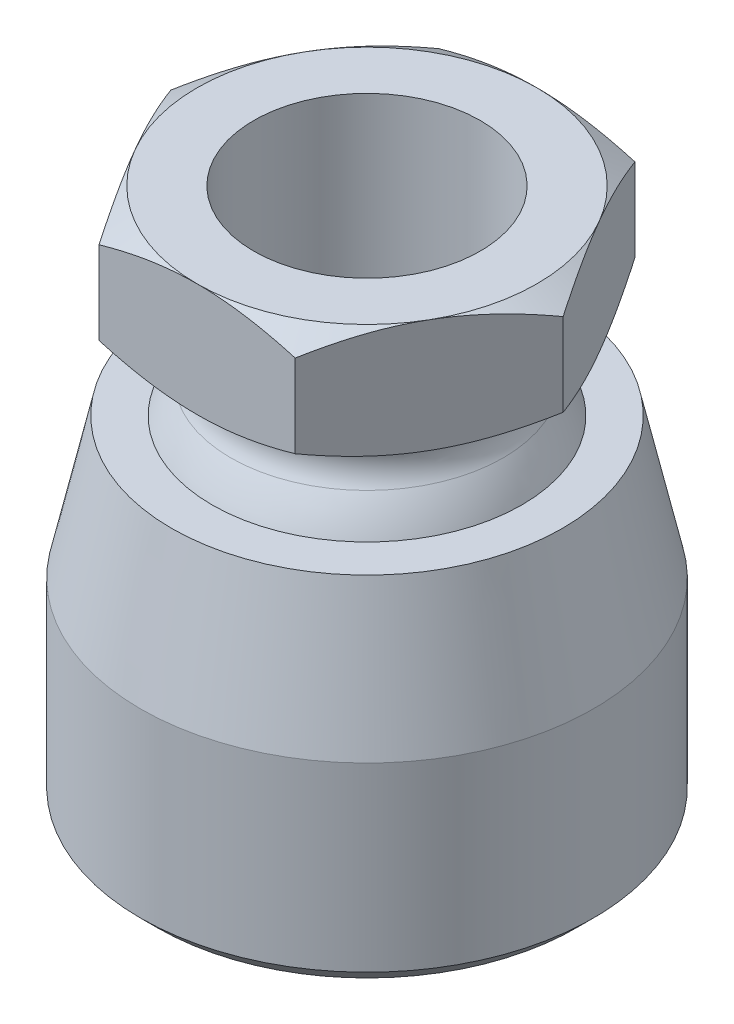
ISO-10303-21;
HEADER;
FILE_DESCRIPTION(('STEP AP214'),'2;1');
FILE_NAME('part.step','',(''),(''),'','','');
FILE_SCHEMA(('AUTOMOTIVE_DESIGN { 1 0 10303 214 1 1 1 1 }'));
ENDSEC;
DATA;
#1=APPLICATION_CONTEXT('core data for automotive mechanical design processes');
#2=APPLICATION_PROTOCOL_DEFINITION('international standard','automotive_design',2000,#1);
#3=PRODUCT_CONTEXT('',#1,'mechanical');
#4=PRODUCT('Part','Part','',(#3));
#5=PRODUCT_RELATED_PRODUCT_CATEGORY('part','',(#4));
#6=PRODUCT_DEFINITION_FORMATION('','',#4);
#7=PRODUCT_DEFINITION_CONTEXT('part definition',#1,'design');
#8=PRODUCT_DEFINITION('design','',#6,#7);
#9=PRODUCT_DEFINITION_SHAPE('','',#8);
#10=(LENGTH_UNIT() NAMED_UNIT(*) SI_UNIT(.MILLI.,.METRE.));
#11=(NAMED_UNIT(*) PLANE_ANGLE_UNIT() SI_UNIT($,.RADIAN.));
#12=(NAMED_UNIT(*) SI_UNIT($,.STERADIAN.) SOLID_ANGLE_UNIT());
#13=UNCERTAINTY_MEASURE_WITH_UNIT(LENGTH_MEASURE(1.E-05),#10,'distance_accuracy_value','');
#14=(GEOMETRIC_REPRESENTATION_CONTEXT(3) GLOBAL_UNCERTAINTY_ASSIGNED_CONTEXT((#13)) GLOBAL_UNIT_ASSIGNED_CONTEXT((#10,
#11,#12)) REPRESENTATION_CONTEXT('',''));
#15=CARTESIAN_POINT('',(0.,0.,0.));
#16=DIRECTION('',(0.,0.,1.));
#17=DIRECTION('',(1.,0.,0.));
#18=AXIS2_PLACEMENT_3D('',#15,#16,#17);
#19=CARTESIAN_POINT('',(0.,0.,0.));
#20=DIRECTION('',(-1.,0.,0.));
#21=DIRECTION('',(0.,1.,0.));
#22=AXIS2_PLACEMENT_3D('',#19,#20,#21);
#23=SPHERICAL_SURFACE('',#22,6.);
#24=CARTESIAN_POINT('',(0.,0.,0.));
#25=DIRECTION('',(0.,-1.,0.));
#26=DIRECTION('',(0.,0.,-1.));
#27=AXIS2_PLACEMENT_3D('',#24,#25,#26);
#28=SPHERICAL_SURFACE('',#27,6.);
#29=CARTESIAN_POINT('',(0.,3.58333333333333,0.));
#30=DIRECTION('',(0.,-1.,0.));
#31=DIRECTION('',(0.,0.,-1.));
#32=AXIS2_PLACEMENT_3D('',#29,#30,#31);
#33=CIRCLE('',#32,4.81245490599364);
#34=CARTESIAN_POINT('',(0.,3.58333333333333,-4.81245490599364));
#35=VERTEX_POINT('',#34);
#36=EDGE_CURVE('P0_E273',#35,#35,#33,.T.);
#37=ORIENTED_EDGE('',*,*,#36,.T.);
#38=EDGE_LOOP('',(#37));
#39=FACE_BOUND('',#38,.T.);
#40=ADVANCED_FACE('P0_F16',(#39),#28,.T.);
#41=CARTESIAN_POINT('',(-3.46410161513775,5.5,6.));
#42=DIRECTION('',(0.,1.,0.));
#43=DIRECTION('',(0.,0.,1.));
#44=AXIS2_PLACEMENT_3D('',#41,#42,#43);
#45=PLANE('',#44);
#46=CARTESIAN_POINT('',(0.,5.5,0.));
#47=DIRECTION('',(0.,1.,0.));
#48=DIRECTION('',(0.,0.,1.));
#49=AXIS2_PLACEMENT_3D('',#46,#47,#48);
#50=CIRCLE('',#49,5.77494588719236);
#51=CARTESIAN_POINT('',(0.,5.5,5.77494588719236));
#52=VERTEX_POINT('',#51);
#53=EDGE_CURVE('P0_E270',#52,#52,#50,.T.);
#54=ORIENTED_EDGE('',*,*,#53,.T.);
#55=EDGE_LOOP('',(#54));
#56=FACE_BOUND('',#55,.T.);
#57=CARTESIAN_POINT('',(0.,5.5,0.));
#58=DIRECTION('',(0.,1.,0.));
#59=DIRECTION('',(0.,0.,1.));
#60=AXIS2_PLACEMENT_3D('',#57,#58,#59);
#61=CIRCLE('',#60,6.);
#62=CARTESIAN_POINT('',(0.,5.5,6.));
#63=VERTEX_POINT('',#62);
#64=CARTESIAN_POINT('',(5.19615242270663,5.5,3.));
#65=VERTEX_POINT('',#64);
#66=EDGE_CURVE('P0_E317',#63,#65,#61,.T.);
#67=ORIENTED_EDGE('',*,*,#66,.F.);
#68=CARTESIAN_POINT('',(-5.19615242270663,5.5,3.));
#69=VERTEX_POINT('',#68);
#70=EDGE_CURVE('P0_E322',#69,#63,#61,.T.);
#71=ORIENTED_EDGE('',*,*,#70,.F.);
#72=CARTESIAN_POINT('',(-5.19615242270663,5.5,-3.));
#73=VERTEX_POINT('',#72);
#74=EDGE_CURVE('P0_E318',#73,#69,#61,.T.);
#75=ORIENTED_EDGE('',*,*,#74,.F.);
#76=CARTESIAN_POINT('',(0.,5.5,-6.));
#77=VERTEX_POINT('',#76);
#78=EDGE_CURVE('P0_E36',#77,#73,#61,.T.);
#79=ORIENTED_EDGE('',*,*,#78,.F.);
#80=CARTESIAN_POINT('',(5.19615242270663,5.5,-3.));
#81=VERTEX_POINT('',#80);
#82=EDGE_CURVE('P0_E44',#81,#77,#61,.T.);
#83=ORIENTED_EDGE('',*,*,#82,.F.);
#84=EDGE_CURVE('P0_E314',#65,#81,#61,.T.);
#85=ORIENTED_EDGE('',*,*,#84,.F.);
#86=EDGE_LOOP('',(#67,#71,#75,#79,#83,#85));
#87=FACE_BOUND('',#86,.T.);
#88=ADVANCED_FACE('P0_F132',(#56,#87),#45,.F.);
#89=CARTESIAN_POINT('',(0.,4.3,0.));
#90=DIRECTION('',(0.,1.,0.));
#91=DIRECTION('',(0.,0.,1.));
#92=AXIS2_PLACEMENT_3D('',#89,#90,#91);
#93=TOROIDAL_SURFACE('',#92,5.77494588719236,1.2);
#94=ORIENTED_EDGE('',*,*,#36,.F.);
#95=EDGE_LOOP('',(#94));
#96=FACE_BOUND('',#95,.T.);
#97=ORIENTED_EDGE('',*,*,#53,.F.);
#98=EDGE_LOOP('',(#97));
#99=FACE_BOUND('',#98,.T.);
#100=ADVANCED_FACE('P0_F18',(#96,#99),#93,.F.);
#101=CARTESIAN_POINT('',(0.,5.5,0.));
#102=DIRECTION('',(0.,1.,0.));
#103=DIRECTION('',(0.,0.,1.));
#104=AXIS2_PLACEMENT_3D('',#101,#102,#103);
#105=CONICAL_SURFACE('',#104,6.,1.0471975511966);
#106=CARTESIAN_POINT('',(-3.46398614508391,6.03596505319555,6.0002));
#107=CARTESIAN_POINT('',(-3.54013114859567,5.99200899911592,5.86831298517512));
#108=CARTESIAN_POINT('',(-3.61656005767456,5.9500478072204,5.73593423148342));
#109=CARTESIAN_POINT('',(-3.77003856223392,5.87066457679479,5.47010166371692));
#110=CARTESIAN_POINT('',(-3.8470884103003,5.83324449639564,5.33664741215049));
#111=CARTESIAN_POINT('',(-4.07947163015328,5.72853041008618,4.93414786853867));
#112=CARTESIAN_POINT('',(-4.23572230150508,5.6689700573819,4.66351376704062));
#113=CARTESIAN_POINT('',(-4.46954859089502,5.59912821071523,4.25851475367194));
#114=CARTESIAN_POINT('',(-4.54642555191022,5.57923222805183,4.12535995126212));
#115=CARTESIAN_POINT('',(-4.70052684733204,5.54586941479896,3.85844867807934));
#116=CARTESIAN_POINT('',(-4.77775115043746,5.53240201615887,3.72469226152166));
#117=CARTESIAN_POINT('',(-4.93233388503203,5.51223959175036,3.45694711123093));
#118=CARTESIAN_POINT('',(-5.00969206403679,5.50553687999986,3.32295881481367));
#119=CARTESIAN_POINT('',(-5.16447561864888,5.49904036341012,3.05486583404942));
#120=CARTESIAN_POINT('',(-5.24190099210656,5.49924634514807,2.92076115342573));
#121=CARTESIAN_POINT('',(-5.4540230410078,5.50930718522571,2.55335498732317));
#122=CARTESIAN_POINT('',(-5.58865028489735,5.52619789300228,2.3201737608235));
#123=CARTESIAN_POINT('',(-5.85701058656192,5.57975922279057,1.85536008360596));
#124=CARTESIAN_POINT('',(-5.9907427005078,5.61644815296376,1.6237292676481));
#125=CARTESIAN_POINT('',(-6.25964310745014,5.7081601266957,1.15798010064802));
#126=CARTESIAN_POINT('',(-6.39477746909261,5.76357175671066,0.923920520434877));
#127=CARTESIAN_POINT('',(-6.66303092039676,5.88933391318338,0.459291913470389));
#128=CARTESIAN_POINT('',(-6.7961534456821,5.95965489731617,0.228716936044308));
#129=CARTESIAN_POINT('',(-6.92831870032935,6.03596505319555,-0.000200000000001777));
#130=B_SPLINE_CURVE_WITH_KNOTS('',3,(#106,#107,#108,#109,#110,#111,#112,#113,#114,#115,#116,
#117,#118,#119,#120,#121,#122,#123,#124,#125,#126,#127,#128,#129),.UNSPECIFIED.,.F.,.F.,(4,2,2,
2,2,2,2,2,2,2,2,4),(0.,0.475482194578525,0.951168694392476,1.90451835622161,2.36951738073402,
2.83447530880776,3.29890435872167,3.76331906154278,4.57182194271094,5.38107376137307,
6.20827406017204,7.03385036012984),.UNSPECIFIED.);
#131=CARTESIAN_POINT('',(-3.46410161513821,6.03589838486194,6.));
#132=VERTEX_POINT('',#131);
#133=EDGE_CURVE('P0_E167',#132,#69,#130,.T.);
#134=ORIENTED_EDGE('',*,*,#133,.T.);
#135=ORIENTED_EDGE('',*,*,#70,.T.);
#136=CARTESIAN_POINT('',(-9.39193968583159,8.47040253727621,6.));
#137=CARTESIAN_POINT('',(-9.12914500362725,8.34257644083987,6.));
#138=CARTESIAN_POINT('',(-8.86575632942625,8.21595105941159,6.));
#139=CARTESIAN_POINT('',(-8.33747546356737,7.96577529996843,6.));
#140=CARTESIAN_POINT('',(-8.07258305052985,7.84222538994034,6.));
#141=CARTESIAN_POINT('',(-7.53965553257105,7.59827100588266,6.));
#142=CARTESIAN_POINT('',(-7.2716112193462,7.47788657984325,6.));
#143=CARTESIAN_POINT('',(-6.73342094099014,7.24192918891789,6.));
#144=CARTESIAN_POINT('',(-6.46327507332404,7.12635600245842,6.));
#145=CARTESIAN_POINT('',(-5.91139022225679,6.89753099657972,6.));
#146=CARTESIAN_POINT('',(-5.62956526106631,6.78448543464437,6.));
#147=CARTESIAN_POINT('',(-5.06265010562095,6.5667414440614,6.));
#148=CARTESIAN_POINT('',(-4.77755955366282,6.46204394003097,6.));
#149=CARTESIAN_POINT('',(-4.20416690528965,6.26368083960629,6.));
#150=CARTESIAN_POINT('',(-3.91587235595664,6.16999363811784,6.));
#151=CARTESIAN_POINT('',(-3.33514514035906,5.99660094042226,6.));
#152=CARTESIAN_POINT('',(-3.04271378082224,5.91689113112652,6.));
#153=CARTESIAN_POINT('',(-2.45521001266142,5.77564845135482,6.));
#154=CARTESIAN_POINT('',(-2.16016256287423,5.71401339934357,6.));
#155=CARTESIAN_POINT('',(-1.56626665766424,5.61235146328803,6.));
#156=CARTESIAN_POINT('',(-1.26741858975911,5.57232239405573,6.));
#157=CARTESIAN_POINT('',(-0.819476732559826,5.53113733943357,6.));
#158=CARTESIAN_POINT('',(-0.671213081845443,5.52056143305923,6.));
#159=CARTESIAN_POINT('',(-0.374364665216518,5.50568793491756,6.));
#160=CARTESIAN_POINT('',(-0.225779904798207,5.50139023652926,6.));
#161=CARTESIAN_POINT('',(0.0714363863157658,5.49918280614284,6.));
#162=CARTESIAN_POINT('',(0.220067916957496,5.50127306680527,6.));
#163=CARTESIAN_POINT('',(0.517108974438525,5.51178751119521,6.));
#164=CARTESIAN_POINT('',(0.665518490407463,5.52021199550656,6.));
#165=CARTESIAN_POINT('',(1.01959496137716,5.54768749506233,6.));
#166=CARTESIAN_POINT('',(1.22504478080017,5.5695997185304,6.));
#167=CARTESIAN_POINT('',(1.63446652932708,5.6243878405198,6.));
#168=CARTESIAN_POINT('',(1.83843826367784,5.65726515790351,6.));
#169=CARTESIAN_POINT('',(2.447877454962,5.77060551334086,6.));
#170=CARTESIAN_POINT('',(2.85065185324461,5.86575783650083,6.));
#171=CARTESIAN_POINT('',(3.45300965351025,6.03135896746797,6.));
#172=CARTESIAN_POINT('',(3.65570163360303,6.09115638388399,6.));
#173=CARTESIAN_POINT('',(4.05911855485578,6.21711314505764,6.));
#174=CARTESIAN_POINT('',(4.25984348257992,6.28327253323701,6.));
#175=CARTESIAN_POINT('',(4.65938632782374,6.42087927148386,6.));
#176=CARTESIAN_POINT('',(4.85820481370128,6.49232498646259,6.));
#177=CARTESIAN_POINT('',(5.25418461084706,6.63964874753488,6.));
#178=CARTESIAN_POINT('',(5.45134594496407,6.71552673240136,6.));
#179=CARTESIAN_POINT('',(5.92940263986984,6.90470002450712,6.));
#180=CARTESIAN_POINT('',(6.20952349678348,7.01994935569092,6.));
#181=CARTESIAN_POINT('',(6.76726206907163,7.25637195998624,6.));
#182=CARTESIAN_POINT('',(7.04487960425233,7.377545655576,6.));
#183=CARTESIAN_POINT('',(7.59809141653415,7.62458505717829,6.));
#184=CARTESIAN_POINT('',(7.87368520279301,7.75045185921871,6.));
#185=CARTESIAN_POINT('',(8.42314734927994,8.00590382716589,6.));
#186=CARTESIAN_POINT('',(8.69701566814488,8.13548908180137,5.99999999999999));
#187=CARTESIAN_POINT('',(9.2436387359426,8.39780947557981,5.99999999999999));
#188=CARTESIAN_POINT('',(9.51639176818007,8.53054818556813,5.99999999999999));
#189=CARTESIAN_POINT('',(10.0606927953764,8.79847604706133,5.99999999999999));
#190=CARTESIAN_POINT('',(10.3322407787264,8.93366522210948,5.99999999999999));
#191=CARTESIAN_POINT('',(11.1452913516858,9.3421944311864,5.99999999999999));
#192=CARTESIAN_POINT('',(11.6852849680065,9.6185370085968,5.99999999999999));
#193=CARTESIAN_POINT('',(12.7147211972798,10.15208982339,5.99999999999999));
#194=CARTESIAN_POINT('',(13.2044089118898,10.4088293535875,5.99999999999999));
#195=CARTESIAN_POINT('',(14.1819736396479,10.9257785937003,5.99999999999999));
#196=CARTESIAN_POINT('',(14.6698505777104,11.1859884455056,5.99999999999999));
#197=CARTESIAN_POINT('',(15.6428640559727,11.7083185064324,5.99999999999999));
#198=CARTESIAN_POINT('',(16.1280044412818,11.9704315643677,5.99999999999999));
#199=CARTESIAN_POINT('',(17.0971347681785,12.4967067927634,5.99999999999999));
#200=CARTESIAN_POINT('',(17.5811247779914,12.760868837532,5.99999999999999));
#201=CARTESIAN_POINT('',(18.0646954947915,13.0257910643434,5.99999999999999));
#202=B_SPLINE_CURVE_WITH_KNOTS('',3,(#136,#137,#138,#139,#140,#141,#142,#143,#144,#145,#146,
#147,#148,#149,#150,#151,#152,#153,#154,#155,#156,#157,#158,#159,#160,#161,#162,#163,#164,#165,
#166,#167,#168,#169,#170,#171,#172,#173,#174,#175,#176,#177,#178,#179,#180,#181,#182,#183,#184,
#185,#186,#187,#188,#189,#190,#191,#192,#193,#194,#195,#196,#197,#198,#199,#200,#201),
.UNSPECIFIED.,.F.,.F.,(4,2,2,2,2,2,2,2,2,2,2,2,2,2,2,2,2,2,2,2,2,2,2,2,2,2,2,2,2,2,2,2,4),(0.,
0.876711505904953,1.75355561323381,2.63502861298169,3.51646097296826,4.42731517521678,
5.33827012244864,6.24740658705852,7.1562620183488,8.0598757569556,8.96339808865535,
9.40920649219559,9.85500732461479,10.300807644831,10.7466291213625,11.36612604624,
11.9857031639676,13.2255081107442,13.8594387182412,14.49337365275,15.1271133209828,
15.7608442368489,16.6694587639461,17.5781381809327,18.4870311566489,19.3959458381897,
20.30594404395,21.2159509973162,23.0356836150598,24.6943983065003,26.353181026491,
28.0074369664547,29.6615922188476),.UNSPECIFIED.);
#203=EDGE_CURVE('P0_E20',#63,#132,#202,.F.);
#204=ORIENTED_EDGE('',*,*,#203,.T.);
#205=EDGE_LOOP('',(#134,#135,#204));
#206=FACE_BOUND('',#205,.T.);
#207=ADVANCED_FACE('P0_F181',(#206),#105,.T.);
#208=CARTESIAN_POINT('',(6.92831870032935,6.03596505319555,-0.000199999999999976));
#209=CARTESIAN_POINT('',(6.85217369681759,5.99200899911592,0.131687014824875));
#210=CARTESIAN_POINT('',(6.7757447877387,5.9500478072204,0.264065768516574));
#211=CARTESIAN_POINT('',(6.62226628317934,5.87066457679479,0.529898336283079));
#212=CARTESIAN_POINT('',(6.54521643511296,5.83324449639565,0.663352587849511));
#213=CARTESIAN_POINT('',(6.31283321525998,5.72853041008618,1.06585213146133));
#214=CARTESIAN_POINT('',(6.15658254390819,5.66897005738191,1.33648623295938));
#215=CARTESIAN_POINT('',(5.92275625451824,5.59912821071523,1.74148524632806));
#216=CARTESIAN_POINT('',(5.84587929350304,5.57923222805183,1.87464004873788));
#217=CARTESIAN_POINT('',(5.69177799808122,5.54586941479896,2.14155132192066));
#218=CARTESIAN_POINT('',(5.6145536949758,5.53240201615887,2.27530773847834));
#219=CARTESIAN_POINT('',(5.45997096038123,5.51223959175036,2.54305288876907));
#220=CARTESIAN_POINT('',(5.38261278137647,5.50553687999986,2.67704118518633));
#221=CARTESIAN_POINT('',(5.22782922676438,5.49904036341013,2.94513416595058));
#222=CARTESIAN_POINT('',(5.1504038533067,5.49924634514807,3.07923884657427));
#223=CARTESIAN_POINT('',(4.93828180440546,5.50930718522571,3.44664501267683));
#224=CARTESIAN_POINT('',(4.80365456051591,5.52619789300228,3.6798262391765));
#225=CARTESIAN_POINT('',(4.53529425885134,5.57975922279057,4.14463991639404));
#226=CARTESIAN_POINT('',(4.40156214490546,5.61644815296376,4.3762707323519));
#227=CARTESIAN_POINT('',(4.13266173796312,5.7081601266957,4.84201989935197));
#228=CARTESIAN_POINT('',(3.99752737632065,5.76357175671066,5.07607947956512));
#229=CARTESIAN_POINT('',(3.7292739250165,5.88933391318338,5.54070808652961));
#230=CARTESIAN_POINT('',(3.59615139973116,5.95965489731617,5.77128306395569));
#231=CARTESIAN_POINT('',(3.46398614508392,6.03596505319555,6.0002));
#232=B_SPLINE_CURVE_WITH_KNOTS('',3,(#208,#209,#210,#211,#212,#213,#214,#215,#216,#217,#218,
#219,#220,#221,#222,#223,#224,#225,#226,#227,#228,#229,#230,#231),.UNSPECIFIED.,.F.,.F.,(4,2,2,
2,2,2,2,2,2,2,2,4),(0.,0.475482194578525,0.951168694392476,1.90451835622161,2.36951738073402,
2.83447530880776,3.29890435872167,3.76331906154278,4.57182194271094,5.38107376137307,
6.20827406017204,7.03385036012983),.UNSPECIFIED.);
#233=CARTESIAN_POINT('',(3.46410161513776,6.03589838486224,6.));
#234=VERTEX_POINT('',#233);
#235=EDGE_CURVE('P0_E189',#65,#234,#232,.T.);
#236=ORIENTED_EDGE('',*,*,#235,.T.);
#237=EDGE_CURVE('P0_E11',#234,#63,#202,.F.);
#238=ORIENTED_EDGE('',*,*,#237,.T.);
#239=ORIENTED_EDGE('',*,*,#66,.T.);
#240=EDGE_LOOP('',(#236,#238,#239));
#241=FACE_BOUND('',#240,.T.);
#242=ADVANCED_FACE('P0_F177',(#241),#105,.T.);
#243=CARTESIAN_POINT('',(3.46398614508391,6.03596505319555,-6.0002));
#244=CARTESIAN_POINT('',(3.54013114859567,5.99200899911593,-5.86831298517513));
#245=CARTESIAN_POINT('',(3.61656005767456,5.9500478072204,-5.73593423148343));
#246=CARTESIAN_POINT('',(3.77003856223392,5.87066457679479,-5.47010166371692));
#247=CARTESIAN_POINT('',(3.8470884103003,5.83324449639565,-5.33664741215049));
#248=CARTESIAN_POINT('',(4.07947163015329,5.72853041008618,-4.93414786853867));
#249=CARTESIAN_POINT('',(4.23572230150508,5.66897005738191,-4.66351376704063));
#250=CARTESIAN_POINT('',(4.46954859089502,5.59912821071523,-4.25851475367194));
#251=CARTESIAN_POINT('',(4.54642555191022,5.57923222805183,-4.12535995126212));
#252=CARTESIAN_POINT('',(4.70052684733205,5.54586941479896,-3.85844867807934));
#253=CARTESIAN_POINT('',(4.77775115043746,5.53240201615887,-3.72469226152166));
#254=CARTESIAN_POINT('',(4.93233388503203,5.51223959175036,-3.45694711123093));
#255=CARTESIAN_POINT('',(5.00969206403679,5.50553687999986,-3.32295881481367));
#256=CARTESIAN_POINT('',(5.16447561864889,5.49904036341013,-3.05486583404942));
#257=CARTESIAN_POINT('',(5.24190099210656,5.49924634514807,-2.92076115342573));
#258=CARTESIAN_POINT('',(5.4540230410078,5.50930718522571,-2.55335498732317));
#259=CARTESIAN_POINT('',(5.58865028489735,5.52619789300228,-2.3201737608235));
#260=CARTESIAN_POINT('',(5.85701058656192,5.57975922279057,-1.85536008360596));
#261=CARTESIAN_POINT('',(5.9907427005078,5.61644815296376,-1.6237292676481));
#262=CARTESIAN_POINT('',(6.25964310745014,5.7081601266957,-1.15798010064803));
#263=CARTESIAN_POINT('',(6.39477746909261,5.76357175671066,-0.923920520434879));
#264=CARTESIAN_POINT('',(6.66303092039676,5.88933391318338,-0.459291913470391));
#265=CARTESIAN_POINT('',(6.7961534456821,5.95965489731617,-0.228716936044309));
#266=CARTESIAN_POINT('',(6.92831870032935,6.03596505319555,0.000199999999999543));
#267=B_SPLINE_CURVE_WITH_KNOTS('',3,(#243,#244,#245,#246,#247,#248,#249,#250,#251,#252,#253,
#254,#255,#256,#257,#258,#259,#260,#261,#262,#263,#264,#265,#266),.UNSPECIFIED.,.F.,.F.,(4,2,2,
2,2,2,2,2,2,2,2,4),(0.,0.475482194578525,0.951168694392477,1.90451835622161,2.36951738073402,
2.83447530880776,3.29890435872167,3.76331906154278,4.57182194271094,5.38107376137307,
6.20827406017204,7.03385036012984),.UNSPECIFIED.);
#268=CARTESIAN_POINT('',(6.92820323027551,6.03589838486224,0.));
#269=VERTEX_POINT('',#268);
#270=EDGE_CURVE('P0_E196',#81,#269,#267,.T.);
#271=ORIENTED_EDGE('',*,*,#270,.T.);
#272=EDGE_CURVE('P0_E304',#269,#65,#232,.T.);
#273=ORIENTED_EDGE('',*,*,#272,.T.);
#274=ORIENTED_EDGE('',*,*,#84,.T.);
#275=EDGE_LOOP('',(#271,#273,#274));
#276=FACE_BOUND('',#275,.T.);
#277=ADVANCED_FACE('P0_F180',(#276),#105,.T.);
#278=CARTESIAN_POINT('',(-9.39193968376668,8.47040253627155,-6.));
#279=CARTESIAN_POINT('',(-9.12914500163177,8.34257643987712,-6.));
#280=CARTESIAN_POINT('',(-8.86575632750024,8.21595105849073,-6.));
#281=CARTESIAN_POINT('',(-8.33747546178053,7.96577529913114,-6.));
#282=CARTESIAN_POINT('',(-8.07258304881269,7.84222538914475,-6.));
#283=CARTESIAN_POINT('',(-7.53965553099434,7.59827100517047,-6.));
#284=CARTESIAN_POINT('',(-7.27161121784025,7.47788657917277,-6.));
#285=CARTESIAN_POINT('',(-6.73342093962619,7.24192918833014,-6.));
#286=CARTESIAN_POINT('',(-6.46327507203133,7.12635600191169,-6.));
#287=CARTESIAN_POINT('',(-5.91139022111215,6.89753099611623,-6.));
#288=CARTESIAN_POINT('',(-5.62956525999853,6.78448543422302,-6.));
#289=CARTESIAN_POINT('',(-5.06265010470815,6.56674144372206,-6.));
#290=CARTESIAN_POINT('',(-4.77755955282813,6.46204393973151,-6.));
#291=CARTESIAN_POINT('',(-4.20416690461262,6.26368083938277,-6.));
#292=CARTESIAN_POINT('',(-3.91587235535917,6.16999363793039,-6.));
#293=CARTESIAN_POINT('',(-3.33514513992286,5.99660094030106,-6.));
#294=CARTESIAN_POINT('',(-3.04271378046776,5.91689113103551,-6.));
#295=CARTESIAN_POINT('',(-2.45521001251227,5.77564845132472,-6.));
#296=CARTESIAN_POINT('',(-2.16016256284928,5.71401339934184,-6.));
#297=CARTESIAN_POINT('',(-1.5662666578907,5.61235146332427,-6.));
#298=CARTESIAN_POINT('',(-1.26741859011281,5.57232239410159,-6.));
#299=CARTESIAN_POINT('',(-0.819476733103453,5.53113733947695,-6.));
#300=CARTESIAN_POINT('',(-0.671213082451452,5.52056143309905,-6.));
#301=CARTESIAN_POINT('',(-0.374364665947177,5.50568793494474,-6.));
#302=CARTESIAN_POINT('',(-0.225779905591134,5.50139023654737,-6.));
#303=CARTESIAN_POINT('',(0.0714363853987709,5.49918280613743,-6.));
#304=CARTESIAN_POINT('',(0.2200679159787,5.50127306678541,-6.));
#305=CARTESIAN_POINT('',(0.517108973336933,5.51178751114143,-6.));
#306=CARTESIAN_POINT('',(0.665518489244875,5.52021199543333,-6.));
#307=CARTESIAN_POINT('',(1.01959496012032,5.54768749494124,-6.));
#308=CARTESIAN_POINT('',(1.22504477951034,5.56959971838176,-6.));
#309=CARTESIAN_POINT('',(1.63446652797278,5.62438784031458,-6.));
#310=CARTESIAN_POINT('',(1.83843826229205,5.65726515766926,-6.));
#311=CARTESIAN_POINT('',(2.44787745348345,5.77060551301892,-6.));
#312=CARTESIAN_POINT('',(2.85065185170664,5.86575783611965,-6.));
#313=CARTESIAN_POINT('',(3.45300965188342,6.03135896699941,-6.));
#314=CARTESIAN_POINT('',(3.65570163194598,6.09115638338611,-6.));
#315=CARTESIAN_POINT('',(4.05911855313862,6.21711314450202,-6.));
#316=CARTESIAN_POINT('',(4.25984348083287,6.28327253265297,-6.));
#317=CARTESIAN_POINT('',(4.65938632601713,6.42087927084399,-6.));
#318=CARTESIAN_POINT('',(4.85820481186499,6.49232498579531,-6.));
#319=CARTESIAN_POINT('',(5.25418460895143,6.63964874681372,-6.));
#320=CARTESIAN_POINT('',(5.45134594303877,6.71552673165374,-6.));
#321=CARTESIAN_POINT('',(5.9294026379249,6.90470002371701,-6.));
#322=CARTESIAN_POINT('',(6.20952349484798,7.01994935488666,-6.));
#323=CARTESIAN_POINT('',(6.7672620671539,7.25637195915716,-6.));
#324=CARTESIAN_POINT('',(7.04487960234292,7.37754565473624,-6.));
#325=CARTESIAN_POINT('',(7.59809141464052,7.62458505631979,-6.));
#326=CARTESIAN_POINT('',(7.87368520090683,7.75045185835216,-6.));
#327=CARTESIAN_POINT('',(8.4231473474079,8.00590382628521,-6.));
#328=CARTESIAN_POINT('',(8.69701566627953,8.1354890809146,-6.));
#329=CARTESIAN_POINT('',(9.24363873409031,8.39780947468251,-6.));
#330=CARTESIAN_POINT('',(9.51639176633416,8.53054818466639,-6.));
#331=CARTESIAN_POINT('',(10.0606927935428,8.79847604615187,-6.));
#332=CARTESIAN_POINT('',(10.3322407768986,8.93366522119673,-6.));
#333=CARTESIAN_POINT('',(11.1452913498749,9.34219443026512,-6.));
#334=CARTESIAN_POINT('',(11.6852849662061,9.61853700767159,-6.));
#335=CARTESIAN_POINT('',(12.714721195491,10.1520898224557,-6.));
#336=CARTESIAN_POINT('',(13.2044089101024,10.4088293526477,-6.));
#337=CARTESIAN_POINT('',(14.1819736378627,10.9257785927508,-6.));
#338=CARTESIAN_POINT('',(14.669850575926,11.1859884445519,-6.));
#339=CARTESIAN_POINT('',(15.6428640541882,11.7083185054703,-6.));
#340=CARTESIAN_POINT('',(16.1280044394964,11.9704315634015,-6.00000000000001));
#341=CARTESIAN_POINT('',(17.0971347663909,12.4967067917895,-6.00000000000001));
#342=CARTESIAN_POINT('',(17.5811247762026,12.7608688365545,-6.00000000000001));
#343=CARTESIAN_POINT('',(18.0646954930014,13.0257910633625,-6.00000000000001));
#344=B_SPLINE_CURVE_WITH_KNOTS('',3,(#278,#279,#280,#281,#282,#283,#284,#285,#286,#287,#288,
#289,#290,#291,#292,#293,#294,#295,#296,#297,#298,#299,#300,#301,#302,#303,#304,#305,#306,#307,
#308,#309,#310,#311,#312,#313,#314,#315,#316,#317,#318,#319,#320,#321,#322,#323,#324,#325,#326,
#327,#328,#329,#330,#331,#332,#333,#334,#335,#336,#337,#338,#339,#340,#341,#342,#343),
.UNSPECIFIED.,.F.,.F.,(4,2,2,2,2,2,2,2,2,2,2,2,2,2,2,2,2,2,2,2,2,2,2,2,2,2,2,2,2,2,2,2,4),(0.,
0.876711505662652,1.75355561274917,2.63502861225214,3.51646097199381,4.42731517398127,
5.33827012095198,6.24740658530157,7.15626201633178,8.05987575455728,8.96339808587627,
9.40920648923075,9.8550073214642,10.3008076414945,10.7466291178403,11.3661260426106,
11.9857031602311,13.2255081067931,13.8594387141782,14.4933736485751,15.1271133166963,
15.7608442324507,16.6694587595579,17.5781381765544,18.4870311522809,19.3959458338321,
20.3059440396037,21.2159509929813,23.0356836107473,24.6943983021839,26.3531810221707,
28.0074369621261,29.6615922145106),.UNSPECIFIED.);
#345=CARTESIAN_POINT('',(3.46410161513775,6.03589838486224,-6.));
#346=VERTEX_POINT('',#345);
#347=EDGE_CURVE('P0_E201',#77,#346,#344,.T.);
#348=ORIENTED_EDGE('',*,*,#347,.T.);
#349=EDGE_CURVE('P0_E207',#346,#81,#267,.T.);
#350=ORIENTED_EDGE('',*,*,#349,.T.);
#351=ORIENTED_EDGE('',*,*,#82,.T.);
#352=EDGE_LOOP('',(#348,#350,#351));
#353=FACE_BOUND('',#352,.T.);
#354=ADVANCED_FACE('P0_F310',(#353),#105,.T.);
#355=CARTESIAN_POINT('',(-6.92831870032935,6.03596505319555,0.000199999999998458));
#356=CARTESIAN_POINT('',(-6.85217369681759,5.99200899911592,-0.131687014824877));
#357=CARTESIAN_POINT('',(-6.7757447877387,5.9500478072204,-0.264065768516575));
#358=CARTESIAN_POINT('',(-6.62226628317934,5.87066457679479,-0.529898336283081));
#359=CARTESIAN_POINT('',(-6.54521643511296,5.83324449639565,-0.663352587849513));
#360=CARTESIAN_POINT('',(-6.31283321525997,5.72853041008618,-1.06585213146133));
#361=CARTESIAN_POINT('',(-6.15658254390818,5.66897005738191,-1.33648623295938));
#362=CARTESIAN_POINT('',(-5.92275625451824,5.59912821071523,-1.74148524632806));
#363=CARTESIAN_POINT('',(-5.84587929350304,5.57923222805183,-1.87464004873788));
#364=CARTESIAN_POINT('',(-5.69177799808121,5.54586941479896,-2.14155132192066));
#365=CARTESIAN_POINT('',(-5.6145536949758,5.53240201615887,-2.27530773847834));
#366=CARTESIAN_POINT('',(-5.45997096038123,5.51223959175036,-2.54305288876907));
#367=CARTESIAN_POINT('',(-5.38261278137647,5.50553687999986,-2.67704118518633));
#368=CARTESIAN_POINT('',(-5.22782922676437,5.49904036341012,-2.94513416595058));
#369=CARTESIAN_POINT('',(-5.1504038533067,5.49924634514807,-3.07923884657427));
#370=CARTESIAN_POINT('',(-4.93828180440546,5.50930718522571,-3.44664501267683));
#371=CARTESIAN_POINT('',(-4.80365456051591,5.52619789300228,-3.6798262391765));
#372=CARTESIAN_POINT('',(-4.53529425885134,5.57975922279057,-4.14463991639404));
#373=CARTESIAN_POINT('',(-4.40156214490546,5.61644815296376,-4.3762707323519));
#374=CARTESIAN_POINT('',(-4.13266173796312,5.7081601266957,-4.84201989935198));
#375=CARTESIAN_POINT('',(-3.99752737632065,5.76357175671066,-5.07607947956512));
#376=CARTESIAN_POINT('',(-3.7292739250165,5.88933391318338,-5.54070808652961));
#377=CARTESIAN_POINT('',(-3.59615139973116,5.95965489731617,-5.77128306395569));
#378=CARTESIAN_POINT('',(-3.46398614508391,6.03596505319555,-6.0002));
#379=B_SPLINE_CURVE_WITH_KNOTS('',3,(#355,#356,#357,#358,#359,#360,#361,#362,#363,#364,#365,
#366,#367,#368,#369,#370,#371,#372,#373,#374,#375,#376,#377,#378),.UNSPECIFIED.,.F.,.F.,(4,2,2,
2,2,2,2,2,2,2,2,4),(0.,0.475482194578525,0.951168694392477,1.90451835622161,2.36951738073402,
2.83447530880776,3.29890435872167,3.76331906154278,4.57182194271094,5.38107376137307,
6.20827406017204,7.03385036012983),.UNSPECIFIED.);
#380=CARTESIAN_POINT('',(-3.46410161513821,6.03589838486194,-6.));
#381=VERTEX_POINT('',#380);
#382=EDGE_CURVE('P0_E169',#73,#381,#379,.T.);
#383=ORIENTED_EDGE('',*,*,#382,.T.);
#384=EDGE_CURVE('P0_E206',#381,#77,#344,.T.);
#385=ORIENTED_EDGE('',*,*,#384,.T.);
#386=ORIENTED_EDGE('',*,*,#78,.T.);
#387=EDGE_LOOP('',(#383,#385,#386));
#388=FACE_BOUND('',#387,.T.);
#389=ADVANCED_FACE('P0_F437',(#388),#105,.T.);
#390=CARTESIAN_POINT('',(-6.92820323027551,6.03589838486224,0.));
#391=VERTEX_POINT('',#390);
#392=EDGE_CURVE('P0_E161',#69,#391,#130,.T.);
#393=ORIENTED_EDGE('',*,*,#392,.T.);
#394=EDGE_CURVE('P0_E168',#391,#73,#379,.T.);
#395=ORIENTED_EDGE('',*,*,#394,.T.);
#396=ORIENTED_EDGE('',*,*,#74,.T.);
#397=EDGE_LOOP('',(#393,#395,#396));
#398=FACE_BOUND('',#397,.T.);
#399=ADVANCED_FACE('P0_F341',(#398),#105,.T.);
#400=CARTESIAN_POINT('',(-3.46410161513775,5.5,6.));
#401=DIRECTION('',(0.,0.,1.));
#402=DIRECTION('',(1.,0.,0.));
#403=AXIS2_PLACEMENT_3D('',#400,#401,#402);
#404=PLANE('',#403);
#405=CARTESIAN_POINT('',(-9.39193968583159,6.52959746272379,6.));
#406=CARTESIAN_POINT('',(-9.12914500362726,6.65742355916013,6.));
#407=CARTESIAN_POINT('',(-8.86575632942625,6.78404894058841,6.));
#408=CARTESIAN_POINT('',(-8.33747546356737,7.03422470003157,6.));
#409=CARTESIAN_POINT('',(-8.07258305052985,7.15777461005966,6.));
#410=CARTESIAN_POINT('',(-7.53965553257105,7.40172899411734,6.));
#411=CARTESIAN_POINT('',(-7.2716112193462,7.52211342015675,6.));
#412=CARTESIAN_POINT('',(-6.73342094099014,7.75807081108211,6.));
#413=CARTESIAN_POINT('',(-6.46327507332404,7.87364399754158,6.));
#414=CARTESIAN_POINT('',(-5.91139022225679,8.10246900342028,6.));
#415=CARTESIAN_POINT('',(-5.6295652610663,8.21551456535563,6.));
#416=CARTESIAN_POINT('',(-5.06265010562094,8.4332585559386,6.));
#417=CARTESIAN_POINT('',(-4.77755955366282,8.53795605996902,6.));
#418=CARTESIAN_POINT('',(-4.20416690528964,8.73631916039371,6.));
#419=CARTESIAN_POINT('',(-3.91587235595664,8.83000636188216,6.));
#420=CARTESIAN_POINT('',(-3.33514514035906,9.00339905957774,6.));
#421=CARTESIAN_POINT('',(-3.04271378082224,9.08310886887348,6.));
#422=CARTESIAN_POINT('',(-2.45521001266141,9.22435154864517,6.));
#423=CARTESIAN_POINT('',(-2.16016256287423,9.28598660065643,6.));
#424=CARTESIAN_POINT('',(-1.56626665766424,9.38764853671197,6.));
#425=CARTESIAN_POINT('',(-1.26741858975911,9.42767760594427,6.));
#426=CARTESIAN_POINT('',(-0.819476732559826,9.46886266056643,6.));
#427=CARTESIAN_POINT('',(-0.671213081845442,9.47943856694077,6.));
#428=CARTESIAN_POINT('',(-0.374364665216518,9.49431206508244,6.));
#429=CARTESIAN_POINT('',(-0.225779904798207,9.49860976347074,6.));
#430=CARTESIAN_POINT('',(0.0714363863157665,9.50081719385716,6.));
#431=CARTESIAN_POINT('',(0.220067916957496,9.49872693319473,6.));
#432=CARTESIAN_POINT('',(0.517108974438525,9.48821248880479,6.));
#433=CARTESIAN_POINT('',(0.665518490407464,9.47978800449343,6.));
#434=CARTESIAN_POINT('',(1.01959496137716,9.45231250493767,6.));
#435=CARTESIAN_POINT('',(1.22504478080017,9.4304002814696,6.));
#436=CARTESIAN_POINT('',(1.63446652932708,9.3756121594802,6.));
#437=CARTESIAN_POINT('',(1.83843826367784,9.34273484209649,6.));
#438=CARTESIAN_POINT('',(2.447877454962,9.22939448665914,6.));
#439=CARTESIAN_POINT('',(2.85065185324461,9.13424216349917,6.));
#440=CARTESIAN_POINT('',(3.45300965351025,8.96864103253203,6.));
#441=CARTESIAN_POINT('',(3.65570163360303,8.90884361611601,6.));
#442=CARTESIAN_POINT('',(4.05911855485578,8.78288685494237,6.));
#443=CARTESIAN_POINT('',(4.25984348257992,8.71672746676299,6.));
#444=CARTESIAN_POINT('',(4.65938632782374,8.57912072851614,6.));
#445=CARTESIAN_POINT('',(4.85820481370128,8.50767501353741,6.));
#446=CARTESIAN_POINT('',(5.25418461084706,8.36035125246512,6.));
#447=CARTESIAN_POINT('',(5.45134594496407,8.28447326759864,6.));
#448=CARTESIAN_POINT('',(5.92940263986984,8.09529997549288,6.));
#449=CARTESIAN_POINT('',(6.20952349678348,7.98005064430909,6.));
#450=CARTESIAN_POINT('',(6.76726206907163,7.74362804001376,6.));
#451=CARTESIAN_POINT('',(7.04487960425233,7.622454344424,6.));
#452=CARTESIAN_POINT('',(7.59809141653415,7.37541494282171,6.));
#453=CARTESIAN_POINT('',(7.87368520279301,7.24954814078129,6.));
#454=CARTESIAN_POINT('',(8.42314734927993,6.99409617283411,6.));
#455=CARTESIAN_POINT('',(8.69701566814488,6.86451091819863,5.99999999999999));
#456=CARTESIAN_POINT('',(9.2436387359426,6.60219052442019,5.99999999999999));
#457=CARTESIAN_POINT('',(9.51639176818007,6.46945181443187,5.99999999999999));
#458=CARTESIAN_POINT('',(10.0606927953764,6.20152395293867,5.99999999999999));
#459=CARTESIAN_POINT('',(10.3322407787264,6.06633477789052,5.99999999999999));
#460=CARTESIAN_POINT('',(11.1452913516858,5.6578055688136,5.99999999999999));
#461=CARTESIAN_POINT('',(11.6852849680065,5.3814629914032,5.99999999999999));
#462=CARTESIAN_POINT('',(12.7147211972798,4.84791017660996,5.99999999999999));
#463=CARTESIAN_POINT('',(13.2044089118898,4.59117064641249,5.99999999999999));
#464=CARTESIAN_POINT('',(14.1819736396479,4.07422140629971,5.99999999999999));
#465=CARTESIAN_POINT('',(14.6698505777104,3.81401155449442,5.99999999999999));
#466=CARTESIAN_POINT('',(15.6428640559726,3.29168149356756,5.99999999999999));
#467=CARTESIAN_POINT('',(16.1280044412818,3.02956843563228,5.99999999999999));
#468=CARTESIAN_POINT('',(17.0971347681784,2.5032932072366,5.99999999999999));
#469=CARTESIAN_POINT('',(17.5811247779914,2.23913116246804,5.99999999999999));
#470=CARTESIAN_POINT('',(18.0646954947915,1.97420893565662,5.99999999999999));
#471=B_SPLINE_CURVE_WITH_KNOTS('',3,(#405,#406,#407,#408,#409,#410,#411,#412,#413,#414,#415,
#416,#417,#418,#419,#420,#421,#422,#423,#424,#425,#426,#427,#428,#429,#430,#431,#432,#433,#434,
#435,#436,#437,#438,#439,#440,#441,#442,#443,#444,#445,#446,#447,#448,#449,#450,#451,#452,#453,
#454,#455,#456,#457,#458,#459,#460,#461,#462,#463,#464,#465,#466,#467,#468,#469,#470),
.UNSPECIFIED.,.F.,.F.,(4,2,2,2,2,2,2,2,2,2,2,2,2,2,2,2,2,2,2,2,2,2,2,2,2,2,2,2,2,2,2,2,4),(0.,
0.876711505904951,1.75355561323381,2.63502861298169,3.51646097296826,4.42731517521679,
5.33827012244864,6.24740658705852,7.1562620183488,8.05987575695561,8.96339808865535,
9.40920649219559,9.85500732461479,10.300807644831,10.7466291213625,11.3661260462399,
11.9857031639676,13.2255081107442,13.8594387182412,14.49337365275,15.1271133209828,
15.7608442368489,16.6694587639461,17.5781381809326,18.4870311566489,19.3959458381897,
20.30594404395,21.2159509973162,23.0356836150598,24.6943983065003,26.353181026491,
28.0074369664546,29.6615922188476),.UNSPECIFIED.);
#472=CARTESIAN_POINT('',(-3.46410161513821,8.96410161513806,6.));
#473=VERTEX_POINT('',#472);
#474=CARTESIAN_POINT('',(0.,9.5,6.));
#475=VERTEX_POINT('',#474);
#476=EDGE_CURVE('P0_E327',#473,#475,#471,.T.);
#477=ORIENTED_EDGE('',*,*,#476,.F.);
#478=DIRECTION('',(0.,1.,0.));
#479=VECTOR('',#478,1.);
#480=CARTESIAN_POINT('',(-3.46410161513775,5.5,6.));
#481=LINE('',#480,#479);
#482=EDGE_CURVE('P0_E286',#132,#473,#481,.T.);
#483=ORIENTED_EDGE('',*,*,#482,.F.);
#484=ORIENTED_EDGE('',*,*,#203,.F.);
#485=ORIENTED_EDGE('',*,*,#237,.F.);
#486=DIRECTION('',(0.,1.,0.));
#487=VECTOR('',#486,1.);
#488=CARTESIAN_POINT('',(3.46410161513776,5.5,6.));
#489=LINE('',#488,#487);
#490=CARTESIAN_POINT('',(3.46410161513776,8.96410161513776,6.));
#491=VERTEX_POINT('',#490);
#492=EDGE_CURVE('P0_E283',#234,#491,#489,.T.);
#493=ORIENTED_EDGE('',*,*,#492,.T.);
#494=EDGE_CURVE('P0_E321',#475,#491,#471,.T.);
#495=ORIENTED_EDGE('',*,*,#494,.F.);
#496=EDGE_LOOP('',(#477,#483,#484,#485,#493,#495));
#497=FACE_BOUND('',#496,.T.);
#498=ADVANCED_FACE('P0_F148',(#497),#404,.T.);
#499=CARTESIAN_POINT('',(3.46410161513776,5.5,6.));
#500=DIRECTION('',(0.866025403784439,0.,0.5));
#501=DIRECTION('',(0.5,0.,-0.866025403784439));
#502=AXIS2_PLACEMENT_3D('',#499,#500,#501);
#503=PLANE('',#502);
#504=CARTESIAN_POINT('',(3.46398614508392,8.96403494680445,6.0002));
#505=CARTESIAN_POINT('',(3.54013114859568,9.00799100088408,5.86831298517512));
#506=CARTESIAN_POINT('',(3.61656005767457,9.0499521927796,5.73593423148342));
#507=CARTESIAN_POINT('',(3.77003856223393,9.12933542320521,5.47010166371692));
#508=CARTESIAN_POINT('',(3.84708841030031,9.16675550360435,5.33664741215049));
#509=CARTESIAN_POINT('',(4.07947163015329,9.27146958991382,4.93414786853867));
#510=CARTESIAN_POINT('',(4.23572230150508,9.33102994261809,4.66351376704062));
#511=CARTESIAN_POINT('',(4.46954859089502,9.40087178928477,4.25851475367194));
#512=CARTESIAN_POINT('',(4.54642555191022,9.42076777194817,4.12535995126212));
#513=CARTESIAN_POINT('',(4.70052684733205,9.45413058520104,3.85844867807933));
#514=CARTESIAN_POINT('',(4.77775115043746,9.46759798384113,3.72469226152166));
#515=CARTESIAN_POINT('',(4.93233388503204,9.48776040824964,3.45694711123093));
#516=CARTESIAN_POINT('',(5.0096920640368,9.49446312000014,3.32295881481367));
#517=CARTESIAN_POINT('',(5.16447561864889,9.50095963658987,3.05486583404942));
#518=CARTESIAN_POINT('',(5.24190099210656,9.50075365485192,2.92076115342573));
#519=CARTESIAN_POINT('',(5.4540230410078,9.49069281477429,2.55335498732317));
#520=CARTESIAN_POINT('',(5.58865028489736,9.47380210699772,2.3201737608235));
#521=CARTESIAN_POINT('',(5.85701058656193,9.42024077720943,1.85536008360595));
#522=CARTESIAN_POINT('',(5.99074270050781,9.38355184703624,1.6237292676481));
#523=CARTESIAN_POINT('',(6.25964310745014,9.2918398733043,1.15798010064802));
#524=CARTESIAN_POINT('',(6.39477746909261,9.23642824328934,0.923920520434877));
#525=CARTESIAN_POINT('',(6.66303092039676,9.11066608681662,0.459291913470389));
#526=CARTESIAN_POINT('',(6.7961534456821,9.04034510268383,0.228716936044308));
#527=CARTESIAN_POINT('',(6.92831870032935,8.96403494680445,-0.000200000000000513));
#528=B_SPLINE_CURVE_WITH_KNOTS('',3,(#504,#505,#506,#507,#508,#509,#510,#511,#512,#513,#514,
#515,#516,#517,#518,#519,#520,#521,#522,#523,#524,#525,#526,#527),.UNSPECIFIED.,.F.,.F.,(4,2,2,
2,2,2,2,2,2,2,2,4),(0.,0.475482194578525,0.951168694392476,1.90451835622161,2.36951738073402,
2.83447530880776,3.29890435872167,3.76331906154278,4.57182194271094,5.38107376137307,
6.20827406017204,7.03385036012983),.UNSPECIFIED.);
#529=CARTESIAN_POINT('',(5.19615242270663,9.5,3.));
#530=VERTEX_POINT('',#529);
#531=EDGE_CURVE('P0_E237',#491,#530,#528,.T.);
#532=ORIENTED_EDGE('',*,*,#531,.F.);
#533=ORIENTED_EDGE('',*,*,#492,.F.);
#534=ORIENTED_EDGE('',*,*,#235,.F.);
#535=ORIENTED_EDGE('',*,*,#272,.F.);
#536=DIRECTION('',(0.,1.,0.));
#537=VECTOR('',#536,1.);
#538=CARTESIAN_POINT('',(6.92820323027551,5.5,0.));
#539=LINE('',#538,#537);
#540=CARTESIAN_POINT('',(6.92820323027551,8.96410161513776,0.));
#541=VERTEX_POINT('',#540);
#542=EDGE_CURVE('P0_E278',#269,#541,#539,.T.);
#543=ORIENTED_EDGE('',*,*,#542,.T.);
#544=EDGE_CURVE('P0_E232',#530,#541,#528,.T.);
#545=ORIENTED_EDGE('',*,*,#544,.F.);
#546=EDGE_LOOP('',(#532,#533,#534,#535,#543,#545));
#547=FACE_BOUND('',#546,.T.);
#548=ADVANCED_FACE('P0_F331',(#547),#503,.T.);
#549=CARTESIAN_POINT('',(6.92820323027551,5.5,0.));
#550=DIRECTION('',(0.866025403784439,0.,-0.5));
#551=DIRECTION('',(-0.5,0.,-0.866025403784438));
#552=AXIS2_PLACEMENT_3D('',#549,#550,#551);
#553=PLANE('',#552);
#554=CARTESIAN_POINT('',(6.92831870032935,8.96403494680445,0.000200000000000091));
#555=CARTESIAN_POINT('',(6.85217369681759,9.00799100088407,-0.131687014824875));
#556=CARTESIAN_POINT('',(6.7757447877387,9.0499521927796,-0.264065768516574));
#557=CARTESIAN_POINT('',(6.62226628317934,9.12933542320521,-0.529898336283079));
#558=CARTESIAN_POINT('',(6.54521643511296,9.16675550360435,-0.663352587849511));
#559=CARTESIAN_POINT('',(6.31283321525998,9.27146958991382,-1.06585213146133));
#560=CARTESIAN_POINT('',(6.15658254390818,9.33102994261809,-1.33648623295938));
#561=CARTESIAN_POINT('',(5.92275625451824,9.40087178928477,-1.74148524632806));
#562=CARTESIAN_POINT('',(5.84587929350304,9.42076777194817,-1.87464004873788));
#563=CARTESIAN_POINT('',(5.69177799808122,9.45413058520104,-2.14155132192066));
#564=CARTESIAN_POINT('',(5.6145536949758,9.46759798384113,-2.27530773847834));
#565=CARTESIAN_POINT('',(5.45997096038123,9.48776040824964,-2.54305288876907));
#566=CARTESIAN_POINT('',(5.38261278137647,9.49446312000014,-2.67704118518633));
#567=CARTESIAN_POINT('',(5.22782922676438,9.50095963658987,-2.94513416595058));
#568=CARTESIAN_POINT('',(5.1504038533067,9.50075365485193,-3.07923884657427));
#569=CARTESIAN_POINT('',(4.93828180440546,9.49069281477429,-3.44664501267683));
#570=CARTESIAN_POINT('',(4.80365456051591,9.47380210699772,-3.6798262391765));
#571=CARTESIAN_POINT('',(4.53529425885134,9.42024077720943,-4.14463991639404));
#572=CARTESIAN_POINT('',(4.40156214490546,9.38355184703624,-4.3762707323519));
#573=CARTESIAN_POINT('',(4.13266173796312,9.2918398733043,-4.84201989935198));
#574=CARTESIAN_POINT('',(3.99752737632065,9.23642824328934,-5.07607947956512));
#575=CARTESIAN_POINT('',(3.7292739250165,9.11066608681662,-5.54070808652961));
#576=CARTESIAN_POINT('',(3.59615139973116,9.04034510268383,-5.77128306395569));
#577=CARTESIAN_POINT('',(3.46398614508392,8.96403494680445,-6.0002));
#578=B_SPLINE_CURVE_WITH_KNOTS('',3,(#554,#555,#556,#557,#558,#559,#560,#561,#562,#563,#564,
#565,#566,#567,#568,#569,#570,#571,#572,#573,#574,#575,#576,#577),.UNSPECIFIED.,.F.,.F.,(4,2,2,
2,2,2,2,2,2,2,2,4),(0.,0.475482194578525,0.951168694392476,1.90451835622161,2.36951738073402,
2.83447530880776,3.29890435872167,3.76331906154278,4.57182194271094,5.38107376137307,
6.20827406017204,7.03385036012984),.UNSPECIFIED.);
#579=CARTESIAN_POINT('',(5.19615242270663,9.5,-3.));
#580=VERTEX_POINT('',#579);
#581=EDGE_CURVE('P0_E228',#541,#580,#578,.T.);
#582=ORIENTED_EDGE('',*,*,#581,.F.);
#583=ORIENTED_EDGE('',*,*,#542,.F.);
#584=ORIENTED_EDGE('',*,*,#270,.F.);
#585=ORIENTED_EDGE('',*,*,#349,.F.);
#586=DIRECTION('',(0.,1.,0.));
#587=VECTOR('',#586,1.);
#588=CARTESIAN_POINT('',(3.46410161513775,5.5,-6.));
#589=LINE('',#588,#587);
#590=CARTESIAN_POINT('',(3.46410161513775,8.96410161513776,-6.));
#591=VERTEX_POINT('',#590);
#592=EDGE_CURVE('P0_E275',#346,#591,#589,.T.);
#593=ORIENTED_EDGE('',*,*,#592,.T.);
#594=EDGE_CURVE('P0_E222',#580,#591,#578,.T.);
#595=ORIENTED_EDGE('',*,*,#594,.F.);
#596=EDGE_LOOP('',(#582,#583,#584,#585,#593,#595));
#597=FACE_BOUND('',#596,.T.);
#598=ADVANCED_FACE('P0_F211',(#597),#553,.T.);
#599=CARTESIAN_POINT('',(3.46410161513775,5.5,-6.));
#600=DIRECTION('',(0.,0.,-1.));
#601=DIRECTION('',(-1.,0.,0.));
#602=AXIS2_PLACEMENT_3D('',#599,#600,#601);
#603=PLANE('',#602);
#604=CARTESIAN_POINT('',(-9.39193968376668,6.52959746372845,-6.));
#605=CARTESIAN_POINT('',(-9.12914500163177,6.65742356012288,-6.));
#606=CARTESIAN_POINT('',(-8.86575632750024,6.78404894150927,-6.));
#607=CARTESIAN_POINT('',(-8.33747546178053,7.03422470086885,-6.));
#608=CARTESIAN_POINT('',(-8.07258304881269,7.15777461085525,-6.));
#609=CARTESIAN_POINT('',(-7.53965553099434,7.40172899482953,-6.));
#610=CARTESIAN_POINT('',(-7.27161121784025,7.52211342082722,-6.));
#611=CARTESIAN_POINT('',(-6.73342093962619,7.75807081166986,-6.));
#612=CARTESIAN_POINT('',(-6.46327507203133,7.87364399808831,-6.));
#613=CARTESIAN_POINT('',(-5.91139022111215,8.10246900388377,-6.));
#614=CARTESIAN_POINT('',(-5.62956525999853,8.21551456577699,-6.));
#615=CARTESIAN_POINT('',(-5.06265010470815,8.43325855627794,-6.));
#616=CARTESIAN_POINT('',(-4.77755955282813,8.53795606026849,-6.));
#617=CARTESIAN_POINT('',(-4.20416690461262,8.73631916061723,-6.));
#618=CARTESIAN_POINT('',(-3.91587235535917,8.83000636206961,-6.));
#619=CARTESIAN_POINT('',(-3.33514513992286,9.00339905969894,-6.));
#620=CARTESIAN_POINT('',(-3.04271378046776,9.08310886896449,-6.));
#621=CARTESIAN_POINT('',(-2.45521001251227,9.22435154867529,-6.));
#622=CARTESIAN_POINT('',(-2.16016256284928,9.28598660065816,-6.));
#623=CARTESIAN_POINT('',(-1.5662666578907,9.38764853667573,-6.));
#624=CARTESIAN_POINT('',(-1.26741859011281,9.42767760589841,-6.));
#625=CARTESIAN_POINT('',(-0.819476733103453,9.46886266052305,-6.));
#626=CARTESIAN_POINT('',(-0.671213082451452,9.47943856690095,-6.));
#627=CARTESIAN_POINT('',(-0.374364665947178,9.49431206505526,-6.));
#628=CARTESIAN_POINT('',(-0.225779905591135,9.49860976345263,-6.));
#629=CARTESIAN_POINT('',(0.0714363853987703,9.50081719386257,-6.));
#630=CARTESIAN_POINT('',(0.2200679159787,9.49872693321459,-6.));
#631=CARTESIAN_POINT('',(0.517108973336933,9.48821248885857,-6.));
#632=CARTESIAN_POINT('',(0.665518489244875,9.47978800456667,-6.));
#633=CARTESIAN_POINT('',(1.01959496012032,9.45231250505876,-6.));
#634=CARTESIAN_POINT('',(1.22504477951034,9.43040028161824,-6.));
#635=CARTESIAN_POINT('',(1.63446652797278,9.37561215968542,-6.));
#636=CARTESIAN_POINT('',(1.83843826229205,9.34273484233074,-6.));
#637=CARTESIAN_POINT('',(2.44787745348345,9.22939448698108,-6.));
#638=CARTESIAN_POINT('',(2.85065185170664,9.13424216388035,-6.));
#639=CARTESIAN_POINT('',(3.45300965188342,8.96864103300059,-6.));
#640=CARTESIAN_POINT('',(3.65570163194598,8.90884361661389,-6.));
#641=CARTESIAN_POINT('',(4.05911855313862,8.78288685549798,-6.));
#642=CARTESIAN_POINT('',(4.25984348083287,8.71672746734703,-6.));
#643=CARTESIAN_POINT('',(4.65938632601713,8.57912072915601,-6.));
#644=CARTESIAN_POINT('',(4.85820481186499,8.50767501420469,-6.));
#645=CARTESIAN_POINT('',(5.25418460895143,8.36035125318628,-6.));
#646=CARTESIAN_POINT('',(5.45134594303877,8.28447326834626,-6.));
#647=CARTESIAN_POINT('',(5.9294026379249,8.09529997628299,-6.));
#648=CARTESIAN_POINT('',(6.20952349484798,7.98005064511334,-6.));
#649=CARTESIAN_POINT('',(6.76726206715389,7.74362804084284,-6.));
#650=CARTESIAN_POINT('',(7.04487960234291,7.62245434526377,-6.));
#651=CARTESIAN_POINT('',(7.59809141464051,7.37541494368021,-6.));
#652=CARTESIAN_POINT('',(7.87368520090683,7.24954814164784,-6.));
#653=CARTESIAN_POINT('',(8.4231473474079,6.99409617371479,-6.));
#654=CARTESIAN_POINT('',(8.69701566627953,6.8645109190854,-6.));
#655=CARTESIAN_POINT('',(9.24363873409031,6.60219052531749,-6.));
#656=CARTESIAN_POINT('',(9.51639176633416,6.46945181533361,-6.));
#657=CARTESIAN_POINT('',(10.0606927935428,6.20152395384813,-6.));
#658=CARTESIAN_POINT('',(10.3322407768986,6.06633477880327,-6.));
#659=CARTESIAN_POINT('',(11.1452913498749,5.65780556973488,-6.));
#660=CARTESIAN_POINT('',(11.6852849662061,5.38146299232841,-6.));
#661=CARTESIAN_POINT('',(12.714721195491,4.84791017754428,-6.));
#662=CARTESIAN_POINT('',(13.2044089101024,4.59117064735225,-6.));
#663=CARTESIAN_POINT('',(14.1819736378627,4.07422140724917,-6.));
#664=CARTESIAN_POINT('',(14.669850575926,3.81401155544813,-6.));
#665=CARTESIAN_POINT('',(15.6428640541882,3.29168149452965,-6.));
#666=CARTESIAN_POINT('',(16.1280044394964,3.02956843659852,-6.00000000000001));
#667=CARTESIAN_POINT('',(17.0971347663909,2.50329320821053,-6.00000000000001));
#668=CARTESIAN_POINT('',(17.5811247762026,2.23913116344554,-6.00000000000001));
#669=CARTESIAN_POINT('',(18.0646954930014,1.9742089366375,-6.00000000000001));
#670=B_SPLINE_CURVE_WITH_KNOTS('',3,(#604,#605,#606,#607,#608,#609,#610,#611,#612,#613,#614,
#615,#616,#617,#618,#619,#620,#621,#622,#623,#624,#625,#626,#627,#628,#629,#630,#631,#632,#633,
#634,#635,#636,#637,#638,#639,#640,#641,#642,#643,#644,#645,#646,#647,#648,#649,#650,#651,#652,
#653,#654,#655,#656,#657,#658,#659,#660,#661,#662,#663,#664,#665,#666,#667,#668,#669),
.UNSPECIFIED.,.F.,.F.,(4,2,2,2,2,2,2,2,2,2,2,2,2,2,2,2,2,2,2,2,2,2,2,2,2,2,2,2,2,2,2,2,4),(0.,
0.876711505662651,1.75355561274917,2.63502861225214,3.51646097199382,4.42731517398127,
5.33827012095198,6.24740658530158,7.15626201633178,8.05987575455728,8.96339808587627,
9.40920648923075,9.8550073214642,10.3008076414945,10.7466291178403,11.3661260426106,
11.9857031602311,13.2255081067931,13.8594387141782,14.4933736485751,15.1271133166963,
15.7608442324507,16.6694587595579,17.5781381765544,18.4870311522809,19.3959458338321,
20.3059440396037,21.2159509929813,23.0356836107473,24.6943983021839,26.3531810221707,
28.0074369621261,29.6615922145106),.UNSPECIFIED.);
#671=CARTESIAN_POINT('',(0.,9.5,-6.));
#672=VERTEX_POINT('',#671);
#673=EDGE_CURVE('P0_E221',#591,#672,#670,.F.);
#674=ORIENTED_EDGE('',*,*,#673,.F.);
#675=ORIENTED_EDGE('',*,*,#592,.F.);
#676=ORIENTED_EDGE('',*,*,#347,.F.);
#677=ORIENTED_EDGE('',*,*,#384,.F.);
#678=DIRECTION('',(0.,1.,0.));
#679=VECTOR('',#678,1.);
#680=CARTESIAN_POINT('',(-3.46410161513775,5.5,-6.));
#681=LINE('',#680,#679);
#682=CARTESIAN_POINT('',(-3.46410161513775,8.96410161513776,-6.));
#683=VERTEX_POINT('',#682);
#684=EDGE_CURVE('P0_E271',#381,#683,#681,.T.);
#685=ORIENTED_EDGE('',*,*,#684,.T.);
#686=EDGE_CURVE('P0_E216',#672,#683,#670,.F.);
#687=ORIENTED_EDGE('',*,*,#686,.F.);
#688=EDGE_LOOP('',(#674,#675,#676,#677,#685,#687));
#689=FACE_BOUND('',#688,.T.);
#690=ADVANCED_FACE('P0_F208',(#689),#603,.T.);
#691=CARTESIAN_POINT('',(-3.46410161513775,5.5,-6.));
#692=DIRECTION('',(-0.866025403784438,0.,-0.5));
#693=DIRECTION('',(-0.5,0.,0.866025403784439));
#694=AXIS2_PLACEMENT_3D('',#691,#692,#693);
#695=PLANE('',#694);
#696=CARTESIAN_POINT('',(-3.46398614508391,8.96403494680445,-6.0002));
#697=CARTESIAN_POINT('',(-3.54013114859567,9.00799100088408,-5.86831298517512));
#698=CARTESIAN_POINT('',(-3.61656005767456,9.0499521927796,-5.73593423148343));
#699=CARTESIAN_POINT('',(-3.77003856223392,9.12933542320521,-5.47010166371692));
#700=CARTESIAN_POINT('',(-3.8470884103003,9.16675550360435,-5.33664741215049));
#701=CARTESIAN_POINT('',(-4.07947163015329,9.27146958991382,-4.93414786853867));
#702=CARTESIAN_POINT('',(-4.23572230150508,9.33102994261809,-4.66351376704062));
#703=CARTESIAN_POINT('',(-4.46954859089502,9.40087178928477,-4.25851475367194));
#704=CARTESIAN_POINT('',(-4.54642555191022,9.42076777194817,-4.12535995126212));
#705=CARTESIAN_POINT('',(-4.70052684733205,9.45413058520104,-3.85844867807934));
#706=CARTESIAN_POINT('',(-4.77775115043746,9.46759798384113,-3.72469226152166));
#707=CARTESIAN_POINT('',(-4.93233388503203,9.48776040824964,-3.45694711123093));
#708=CARTESIAN_POINT('',(-5.00969206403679,9.49446312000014,-3.32295881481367));
#709=CARTESIAN_POINT('',(-5.16447561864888,9.50095963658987,-3.05486583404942));
#710=CARTESIAN_POINT('',(-5.24190099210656,9.50075365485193,-2.92076115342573));
#711=CARTESIAN_POINT('',(-5.4540230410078,9.49069281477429,-2.55335498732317));
#712=CARTESIAN_POINT('',(-5.58865028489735,9.47380210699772,-2.3201737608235));
#713=CARTESIAN_POINT('',(-5.85701058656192,9.42024077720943,-1.85536008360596));
#714=CARTESIAN_POINT('',(-5.9907427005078,9.38355184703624,-1.6237292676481));
#715=CARTESIAN_POINT('',(-6.25964310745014,9.2918398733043,-1.15798010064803));
#716=CARTESIAN_POINT('',(-6.39477746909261,9.23642824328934,-0.923920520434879));
#717=CARTESIAN_POINT('',(-6.66303092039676,9.11066608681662,-0.459291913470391));
#718=CARTESIAN_POINT('',(-6.7961534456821,9.04034510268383,-0.228716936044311));
#719=CARTESIAN_POINT('',(-6.92831870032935,8.96403494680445,0.00019999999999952));
#720=B_SPLINE_CURVE_WITH_KNOTS('',3,(#696,#697,#698,#699,#700,#701,#702,#703,#704,#705,#706,
#707,#708,#709,#710,#711,#712,#713,#714,#715,#716,#717,#718,#719),.UNSPECIFIED.,.F.,.F.,(4,2,2,
2,2,2,2,2,2,2,2,4),(0.,0.475482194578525,0.951168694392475,1.90451835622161,2.36951738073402,
2.83447530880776,3.29890435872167,3.76331906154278,4.57182194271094,5.38107376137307,
6.20827406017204,7.03385036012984),.UNSPECIFIED.);
#721=CARTESIAN_POINT('',(-5.19615242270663,9.5,-3.));
#722=VERTEX_POINT('',#721);
#723=EDGE_CURVE('P0_E227',#683,#722,#720,.T.);
#724=ORIENTED_EDGE('',*,*,#723,.F.);
#725=ORIENTED_EDGE('',*,*,#684,.F.);
#726=ORIENTED_EDGE('',*,*,#382,.F.);
#727=ORIENTED_EDGE('',*,*,#394,.F.);
#728=DIRECTION('',(0.,1.,0.));
#729=VECTOR('',#728,1.);
#730=CARTESIAN_POINT('',(-6.92820323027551,5.5,0.));
#731=LINE('',#730,#729);
#732=CARTESIAN_POINT('',(-6.92820323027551,8.96410161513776,0.));
#733=VERTEX_POINT('',#732);
#734=EDGE_CURVE('P0_E175',#391,#733,#731,.T.);
#735=ORIENTED_EDGE('',*,*,#734,.T.);
#736=EDGE_CURVE('P0_E223',#722,#733,#720,.T.);
#737=ORIENTED_EDGE('',*,*,#736,.F.);
#738=EDGE_LOOP('',(#724,#725,#726,#727,#735,#737));
#739=FACE_BOUND('',#738,.T.);
#740=ADVANCED_FACE('P0_F146',(#739),#695,.T.);
#741=CARTESIAN_POINT('',(-6.92820323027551,5.5,0.));
#742=DIRECTION('',(-0.866025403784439,0.,0.5));
#743=DIRECTION('',(0.5,0.,0.866025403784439));
#744=AXIS2_PLACEMENT_3D('',#741,#742,#743);
#745=PLANE('',#744);
#746=CARTESIAN_POINT('',(-6.92831870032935,8.96403494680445,-0.000200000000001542));
#747=CARTESIAN_POINT('',(-6.85217369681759,9.00799100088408,0.131687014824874));
#748=CARTESIAN_POINT('',(-6.7757447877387,9.0499521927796,0.264065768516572));
#749=CARTESIAN_POINT('',(-6.62226628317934,9.12933542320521,0.529898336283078));
#750=CARTESIAN_POINT('',(-6.54521643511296,9.16675550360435,0.663352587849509));
#751=CARTESIAN_POINT('',(-6.31283321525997,9.27146958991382,1.06585213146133));
#752=CARTESIAN_POINT('',(-6.15658254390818,9.33102994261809,1.33648623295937));
#753=CARTESIAN_POINT('',(-5.92275625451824,9.40087178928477,1.74148524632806));
#754=CARTESIAN_POINT('',(-5.84587929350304,9.42076777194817,1.87464004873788));
#755=CARTESIAN_POINT('',(-5.69177799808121,9.45413058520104,2.14155132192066));
#756=CARTESIAN_POINT('',(-5.6145536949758,9.46759798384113,2.27530773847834));
#757=CARTESIAN_POINT('',(-5.45997096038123,9.48776040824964,2.54305288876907));
#758=CARTESIAN_POINT('',(-5.38261278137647,9.49446312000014,2.67704118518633));
#759=CARTESIAN_POINT('',(-5.22782922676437,9.50095963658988,2.94513416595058));
#760=CARTESIAN_POINT('',(-5.1504038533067,9.50075365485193,3.07923884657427));
#761=CARTESIAN_POINT('',(-4.93828180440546,9.49069281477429,3.44664501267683));
#762=CARTESIAN_POINT('',(-4.80365456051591,9.47380210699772,3.6798262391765));
#763=CARTESIAN_POINT('',(-4.53529425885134,9.42024077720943,4.14463991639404));
#764=CARTESIAN_POINT('',(-4.40156214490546,9.38355184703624,4.3762707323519));
#765=CARTESIAN_POINT('',(-4.13266173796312,9.2918398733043,4.84201989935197));
#766=CARTESIAN_POINT('',(-3.99752737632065,9.23642824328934,5.07607947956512));
#767=CARTESIAN_POINT('',(-3.7292739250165,9.11066608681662,5.54070808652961));
#768=CARTESIAN_POINT('',(-3.59615139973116,9.04034510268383,5.77128306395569));
#769=CARTESIAN_POINT('',(-3.46398614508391,8.96403494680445,6.0002));
#770=B_SPLINE_CURVE_WITH_KNOTS('',3,(#746,#747,#748,#749,#750,#751,#752,#753,#754,#755,#756,
#757,#758,#759,#760,#761,#762,#763,#764,#765,#766,#767,#768,#769),.UNSPECIFIED.,.F.,.F.,(4,2,2,
2,2,2,2,2,2,2,2,4),(0.,0.475482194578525,0.951168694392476,1.90451835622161,2.36951738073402,
2.83447530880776,3.29890435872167,3.76331906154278,4.57182194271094,5.38107376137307,
6.20827406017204,7.03385036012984),.UNSPECIFIED.);
#771=CARTESIAN_POINT('',(-5.19615242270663,9.5,3.));
#772=VERTEX_POINT('',#771);
#773=EDGE_CURVE('P0_E236',#733,#772,#770,.T.);
#774=ORIENTED_EDGE('',*,*,#773,.F.);
#775=ORIENTED_EDGE('',*,*,#734,.F.);
#776=ORIENTED_EDGE('',*,*,#392,.F.);
#777=ORIENTED_EDGE('',*,*,#133,.F.);
#778=ORIENTED_EDGE('',*,*,#482,.T.);
#779=EDGE_CURVE('P0_E153',#772,#473,#770,.T.);
#780=ORIENTED_EDGE('',*,*,#779,.F.);
#781=EDGE_LOOP('',(#774,#775,#776,#777,#778,#780));
#782=FACE_BOUND('',#781,.T.);
#783=ADVANCED_FACE('P0_F142',(#782),#745,.T.);
#784=CARTESIAN_POINT('',(0.,7.5,0.));
#785=DIRECTION('',(0.,-1.,0.));
#786=DIRECTION('',(0.,0.,-1.));
#787=AXIS2_PLACEMENT_3D('',#784,#785,#786);
#788=CONICAL_SURFACE('',#787,9.46410161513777,1.0471975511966);
#789=ORIENTED_EDGE('',*,*,#531,.T.);
#790=CARTESIAN_POINT('',(0.,9.5,0.));
#791=DIRECTION('',(0.,1.,0.));
#792=DIRECTION('',(0.,0.,1.));
#793=AXIS2_PLACEMENT_3D('',#790,#791,#792);
#794=CIRCLE('',#793,6.);
#795=EDGE_CURVE('P0_E296',#475,#530,#794,.T.);
#796=ORIENTED_EDGE('',*,*,#795,.F.);
#797=ORIENTED_EDGE('',*,*,#494,.T.);
#798=EDGE_LOOP('',(#789,#796,#797));
#799=FACE_BOUND('',#798,.T.);
#800=ADVANCED_FACE('P0_F145',(#799),#788,.T.);
#801=ORIENTED_EDGE('',*,*,#581,.T.);
#802=CARTESIAN_POINT('',(0.,9.5,0.));
#803=DIRECTION('',(0.,1.,0.));
#804=DIRECTION('',(0.,0.,1.));
#805=AXIS2_PLACEMENT_3D('',#802,#803,#804);
#806=CIRCLE('',#805,6.);
#807=EDGE_CURVE('P0_E289',#580,#530,#806,.F.);
#808=ORIENTED_EDGE('',*,*,#807,.T.);
#809=ORIENTED_EDGE('',*,*,#544,.T.);
#810=EDGE_LOOP('',(#801,#808,#809));
#811=FACE_BOUND('',#810,.T.);
#812=ADVANCED_FACE('P0_F467',(#811),#788,.T.);
#813=ORIENTED_EDGE('',*,*,#673,.T.);
#814=EDGE_CURVE('P0_E264',#672,#580,#806,.F.);
#815=ORIENTED_EDGE('',*,*,#814,.T.);
#816=ORIENTED_EDGE('',*,*,#594,.T.);
#817=EDGE_LOOP('',(#813,#815,#816));
#818=FACE_BOUND('',#817,.T.);
#819=ADVANCED_FACE('P0_F293',(#818),#788,.T.);
#820=ORIENTED_EDGE('',*,*,#686,.T.);
#821=ORIENTED_EDGE('',*,*,#723,.T.);
#822=EDGE_CURVE('P0_E247',#722,#672,#806,.F.);
#823=ORIENTED_EDGE('',*,*,#822,.T.);
#824=EDGE_LOOP('',(#820,#821,#823));
#825=FACE_BOUND('',#824,.T.);
#826=ADVANCED_FACE('P0_F245',(#825),#788,.T.);
#827=ORIENTED_EDGE('',*,*,#736,.T.);
#828=ORIENTED_EDGE('',*,*,#773,.T.);
#829=EDGE_CURVE('P0_E256',#772,#722,#806,.F.);
#830=ORIENTED_EDGE('',*,*,#829,.T.);
#831=EDGE_LOOP('',(#827,#828,#830));
#832=FACE_BOUND('',#831,.T.);
#833=ADVANCED_FACE('P0_F257',(#832),#788,.T.);
#834=ORIENTED_EDGE('',*,*,#779,.T.);
#835=ORIENTED_EDGE('',*,*,#476,.T.);
#836=EDGE_CURVE('P0_E262',#475,#772,#806,.F.);
#837=ORIENTED_EDGE('',*,*,#836,.T.);
#838=EDGE_LOOP('',(#834,#835,#837));
#839=FACE_BOUND('',#838,.T.);
#840=ADVANCED_FACE('P0_F127',(#839),#788,.T.);
#841=CARTESIAN_POINT('',(-3.46410161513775,9.5,6.));
#842=DIRECTION('',(0.,1.,0.));
#843=DIRECTION('',(0.,0.,1.));
#844=AXIS2_PLACEMENT_3D('',#841,#842,#843);
#845=PLANE('',#844);
#846=CARTESIAN_POINT('',(0.,9.5,0.));
#847=DIRECTION('',(0.,-1.,0.));
#848=DIRECTION('',(0.,0.,-1.));
#849=AXIS2_PLACEMENT_3D('',#846,#847,#848);
#850=CIRCLE('',#849,4.);
#851=CARTESIAN_POINT('',(0.,9.5,-4.));
#852=VERTEX_POINT('',#851);
#853=EDGE_CURVE('P0_E353',#852,#852,#850,.T.);
#854=ORIENTED_EDGE('',*,*,#853,.T.);
#855=EDGE_LOOP('',(#854));
#856=FACE_BOUND('',#855,.T.);
#857=ORIENTED_EDGE('',*,*,#836,.F.);
#858=ORIENTED_EDGE('',*,*,#795,.T.);
#859=ORIENTED_EDGE('',*,*,#807,.F.);
#860=ORIENTED_EDGE('',*,*,#814,.F.);
#861=ORIENTED_EDGE('',*,*,#822,.F.);
#862=ORIENTED_EDGE('',*,*,#829,.F.);
#863=EDGE_LOOP('',(#857,#858,#859,#860,#861,#862));
#864=FACE_BOUND('',#863,.T.);
#865=ADVANCED_FACE('P0_F115',(#856,#864),#845,.T.);
#866=CARTESIAN_POINT('',(0.,-3.5,0.));
#867=DIRECTION('',(0.,1.,0.));
#868=DIRECTION('',(0.,0.,1.));
#869=AXIS2_PLACEMENT_3D('',#866,#867,#868);
#870=CONICAL_SURFACE('',#869,0.,1.04719755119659);
#871=CARTESIAN_POINT('',(0.,-1.53700908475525,0.));
#872=DIRECTION('',(0.,-1.,0.));
#873=DIRECTION('',(0.,0.,-1.));
#874=AXIS2_PLACEMENT_3D('',#871,#872,#873);
#875=CIRCLE('',#874,3.4);
#876=CARTESIAN_POINT('',(0.,-1.53700908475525,-3.4));
#877=VERTEX_POINT('',#876);
#878=EDGE_CURVE('P0_E363',#877,#877,#875,.T.);
#879=ORIENTED_EDGE('',*,*,#878,.F.);
#880=EDGE_LOOP('',(#879));
#881=FACE_BOUND('',#880,.T.);
#882=CARTESIAN_POINT('',(0.,-3.5,0.));
#883=VERTEX_POINT('',#882);
#884=VERTEX_LOOP('',#883);
#885=FACE_BOUND('',#884,.T.);
#886=ADVANCED_FACE('P0_F112',(#881,#885),#870,.F.);
#887=CARTESIAN_POINT('',(0.,0.,0.));
#888=DIRECTION('',(0.,-1.,0.));
#889=DIRECTION('',(0.,0.,-1.));
#890=AXIS2_PLACEMENT_3D('',#887,#888,#889);
#891=CYLINDRICAL_SURFACE('',#890,4.);
#892=ORIENTED_EDGE('',*,*,#853,.F.);
#893=EDGE_LOOP('',(#892));
#894=FACE_BOUND('',#893,.T.);
#895=CARTESIAN_POINT('',(0.,0.500000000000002,0.));
#896=DIRECTION('',(0.,-1.,0.));
#897=DIRECTION('',(0.,0.,-1.));
#898=AXIS2_PLACEMENT_3D('',#895,#896,#897);
#899=CIRCLE('',#898,4.);
#900=CARTESIAN_POINT('',(0.,0.500000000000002,-4.));
#901=VERTEX_POINT('',#900);
#902=EDGE_CURVE('P0_E355',#901,#901,#899,.T.);
#903=ORIENTED_EDGE('',*,*,#902,.T.);
#904=EDGE_LOOP('',(#903));
#905=FACE_BOUND('',#904,.T.);
#906=ADVANCED_FACE('P0_F114',(#894,#905),#891,.F.);
#907=CARTESIAN_POINT('',(4.,0.500000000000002,0.));
#908=DIRECTION('',(0.,-1.,0.));
#909=DIRECTION('',(0.,0.,-1.));
#910=AXIS2_PLACEMENT_3D('',#907,#908,#909);
#911=PLANE('',#910);
#912=ORIENTED_EDGE('',*,*,#902,.F.);
#913=EDGE_LOOP('',(#912));
#914=FACE_BOUND('',#913,.T.);
#915=CARTESIAN_POINT('',(0.,0.500000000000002,0.));
#916=DIRECTION('',(0.,-1.,0.));
#917=DIRECTION('',(0.,0.,-1.));
#918=AXIS2_PLACEMENT_3D('',#915,#916,#917);
#919=CIRCLE('',#918,3.4);
#920=CARTESIAN_POINT('',(0.,0.500000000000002,-3.4));
#921=VERTEX_POINT('',#920);
#922=EDGE_CURVE('P0_E358',#921,#921,#919,.T.);
#923=ORIENTED_EDGE('',*,*,#922,.T.);
#924=EDGE_LOOP('',(#923));
#925=FACE_BOUND('',#924,.T.);
#926=ADVANCED_FACE('P0_F124',(#914,#925),#911,.F.);
#927=CARTESIAN_POINT('',(0.,0.,0.));
#928=DIRECTION('',(0.,-1.,0.));
#929=DIRECTION('',(0.,0.,-1.));
#930=AXIS2_PLACEMENT_3D('',#927,#928,#929);
#931=CYLINDRICAL_SURFACE('',#930,3.4);
#932=ORIENTED_EDGE('',*,*,#922,.F.);
#933=EDGE_LOOP('',(#932));
#934=FACE_BOUND('',#933,.T.);
#935=ORIENTED_EDGE('',*,*,#878,.T.);
#936=EDGE_LOOP('',(#935));
#937=FACE_BOUND('',#936,.T.);
#938=ADVANCED_FACE('P0_F366',(#934,#937),#931,.F.);
#939=CLOSED_SHELL('',(#40,#88,#100,#207,#242,#277,#354,#389,#399,#498,#548,#598,#690,#740,#783,
#800,#812,#819,#826,#833,#840,#865,#886,#906,#926,#938));
#940=MANIFOLD_SOLID_BREP('P0_B1',#939);
#941=CARTESIAN_POINT('',(0.,2.47,0.));
#942=DIRECTION('',(0.,-1.,0.));
#943=DIRECTION('',(0.,0.,-1.));
#944=AXIS2_PLACEMENT_3D('',#941,#942,#943);
#945=CYLINDRICAL_SURFACE('',#944,8.);
#946=CARTESIAN_POINT('',(0.,-8.89999999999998,0.));
#947=DIRECTION('',(0.,1.,0.));
#948=DIRECTION('',(0.,0.,1.));
#949=AXIS2_PLACEMENT_3D('',#946,#947,#948);
#950=CIRCLE('',#949,8.);
#951=CARTESIAN_POINT('',(0.,-8.89999999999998,-8.));
#952=VERTEX_POINT('',#951);
#953=EDGE_CURVE('P1_E20',#952,#952,#950,.T.);
#954=CARTESIAN_POINT('',(0.,-2.5,0.));
#955=DIRECTION('',(0.,1.,0.));
#956=DIRECTION('',(0.,0.,1.));
#957=AXIS2_PLACEMENT_3D('',#954,#955,#956);
#958=CIRCLE('',#957,8.);
#959=CARTESIAN_POINT('',(0.,-2.5,-8.));
#960=VERTEX_POINT('',#959);
#961=EDGE_CURVE('P1_E33',#960,#960,#958,.T.);
#962=CARTESIAN_POINT('',(0.,-8.89999999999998,-8.));
#963=CARTESIAN_POINT('',(0.,-8.83333333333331,-8.));
#964=CARTESIAN_POINT('',(0.,-8.76666666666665,-8.));
#965=CARTESIAN_POINT('',(0.,-8.63333333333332,-8.));
#966=CARTESIAN_POINT('',(0.,-8.56666666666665,-8.));
#967=CARTESIAN_POINT('',(0.,-8.43333333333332,-8.));
#968=CARTESIAN_POINT('',(0.,-8.36666666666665,-8.));
#969=CARTESIAN_POINT('',(0.,-8.23333333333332,-8.));
#970=CARTESIAN_POINT('',(0.,-8.16666666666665,-8.));
#971=CARTESIAN_POINT('',(0.,-8.03333333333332,-8.));
#972=CARTESIAN_POINT('',(0.,-7.96666666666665,-8.));
#973=CARTESIAN_POINT('',(0.,-7.83333333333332,-8.));
#974=CARTESIAN_POINT('',(0.,-7.76666666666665,-8.));
#975=CARTESIAN_POINT('',(0.,-7.63333333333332,-8.));
#976=CARTESIAN_POINT('',(0.,-7.56666666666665,-8.));
#977=CARTESIAN_POINT('',(0.,-7.43333333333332,-8.));
#978=CARTESIAN_POINT('',(0.,-7.36666666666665,-8.));
#979=CARTESIAN_POINT('',(0.,-7.23333333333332,-8.));
#980=CARTESIAN_POINT('',(0.,-7.16666666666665,-8.));
#981=CARTESIAN_POINT('',(0.,-7.03333333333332,-8.));
#982=CARTESIAN_POINT('',(0.,-6.96666666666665,-8.));
#983=CARTESIAN_POINT('',(0.,-6.83333333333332,-8.));
#984=CARTESIAN_POINT('',(0.,-6.76666666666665,-8.));
#985=CARTESIAN_POINT('',(0.,-6.63333333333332,-8.));
#986=CARTESIAN_POINT('',(0.,-6.56666666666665,-8.));
#987=CARTESIAN_POINT('',(0.,-6.43333333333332,-8.));
#988=CARTESIAN_POINT('',(0.,-6.36666666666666,-8.));
#989=CARTESIAN_POINT('',(0.,-6.23333333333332,-8.));
#990=CARTESIAN_POINT('',(0.,-6.16666666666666,-8.));
#991=CARTESIAN_POINT('',(0.,-6.03333333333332,-8.));
#992=CARTESIAN_POINT('',(0.,-5.96666666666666,-8.));
#993=CARTESIAN_POINT('',(0.,-5.83333333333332,-8.));
#994=CARTESIAN_POINT('',(0.,-5.76666666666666,-8.));
#995=CARTESIAN_POINT('',(0.,-5.63333333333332,-8.));
#996=CARTESIAN_POINT('',(0.,-5.56666666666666,-8.));
#997=CARTESIAN_POINT('',(0.,-5.43333333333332,-8.));
#998=CARTESIAN_POINT('',(0.,-5.36666666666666,-8.));
#999=CARTESIAN_POINT('',(0.,-5.23333333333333,-8.));
#1000=CARTESIAN_POINT('',(0.,-5.16666666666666,-8.));
#1001=CARTESIAN_POINT('',(0.,-5.03333333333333,-8.));
#1002=CARTESIAN_POINT('',(0.,-4.96666666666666,-8.));
#1003=CARTESIAN_POINT('',(0.,-4.83333333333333,-8.));
#1004=CARTESIAN_POINT('',(0.,-4.76666666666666,-8.));
#1005=CARTESIAN_POINT('',(0.,-4.63333333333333,-8.));
#1006=CARTESIAN_POINT('',(0.,-4.56666666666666,-8.));
#1007=CARTESIAN_POINT('',(0.,-4.43333333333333,-8.));
#1008=CARTESIAN_POINT('',(0.,-4.36666666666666,-8.));
#1009=CARTESIAN_POINT('',(0.,-4.23333333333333,-8.));
#1010=CARTESIAN_POINT('',(0.,-4.16666666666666,-8.));
#1011=CARTESIAN_POINT('',(0.,-4.03333333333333,-8.));
#1012=CARTESIAN_POINT('',(0.,-3.96666666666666,-8.));
#1013=CARTESIAN_POINT('',(0.,-3.83333333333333,-8.));
#1014=CARTESIAN_POINT('',(0.,-3.76666666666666,-8.));
#1015=CARTESIAN_POINT('',(0.,-3.63333333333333,-8.));
#1016=CARTESIAN_POINT('',(0.,-3.56666666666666,-8.));
#1017=CARTESIAN_POINT('',(0.,-3.43333333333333,-8.));
#1018=CARTESIAN_POINT('',(0.,-3.36666666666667,-8.));
#1019=CARTESIAN_POINT('',(0.,-3.23333333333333,-8.));
#1020=CARTESIAN_POINT('',(0.,-3.16666666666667,-8.));
#1021=CARTESIAN_POINT('',(0.,-3.03333333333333,-8.));
#1022=CARTESIAN_POINT('',(0.,-2.96666666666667,-8.));
#1023=CARTESIAN_POINT('',(0.,-2.83333333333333,-8.));
#1024=CARTESIAN_POINT('',(0.,-2.76666666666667,-8.));
#1025=CARTESIAN_POINT('',(0.,-2.63333333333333,-8.));
#1026=CARTESIAN_POINT('',(0.,-2.56666666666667,-8.));
#1027=CARTESIAN_POINT('',(0.,-2.5,-8.));
#1028=B_SPLINE_CURVE_WITH_KNOTS('',3,(#962,#963,#964,#965,#966,#967,#968,#969,#970,#971,#972,
#973,#974,#975,#976,#977,#978,#979,#980,#981,#982,#983,#984,#985,#986,#987,#988,#989,#990,#991,
#992,#993,#994,#995,#996,#997,#998,#999,#1000,#1001,#1002,#1003,#1004,#1005,#1006,#1007,#1008,
#1009,#1010,#1011,#1012,#1013,#1014,#1015,#1016,#1017,#1018,#1019,#1020,#1021,#1022,#1023,#1024,
#1025,#1026,#1027),.UNSPECIFIED.,.F.,.F.,(4,2,2,2,2,2,2,2,2,2,2,2,2,2,2,2,2,2,2,2,2,2,2,2,2,2,2,
2,2,2,2,2,4),(0.,0.199999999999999,0.399999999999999,0.599999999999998,0.799999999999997,
0.999999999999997,1.2,1.4,1.6,1.79999999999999,1.99999999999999,2.19999999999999,
2.39999999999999,2.59999999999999,2.79999999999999,2.99999999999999,3.19999999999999,
3.39999999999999,3.59999999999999,3.79999999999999,3.99999999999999,4.19999999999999,
4.39999999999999,4.59999999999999,4.79999999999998,4.99999999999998,5.19999999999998,
5.39999999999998,5.59999999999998,5.79999999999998,5.99999999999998,6.19999999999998,
6.39999999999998),.UNSPECIFIED.);
#1029=EDGE_CURVE('P1_BSEAM13',#952,#960,#1028,.T.);
#1030=ORIENTED_EDGE('',*,*,#953,.T.);
#1031=ORIENTED_EDGE('',*,*,#961,.F.);
#1032=ORIENTED_EDGE('',*,*,#1029,.T.);
#1033=ORIENTED_EDGE('',*,*,#1029,.F.);
#1034=EDGE_LOOP('',(#1030,#1032,#1031,#1033));
#1035=FACE_BOUND('',#1034,.T.);
#1036=ADVANCED_FACE('P1_F13',(#1035),#945,.T.);
#1037=CARTESIAN_POINT('',(0.,-9.5,0.));
#1038=DIRECTION('',(0.,1.,0.));
#1039=DIRECTION('',(0.,0.,1.));
#1040=AXIS2_PLACEMENT_3D('',#1037,#1038,#1039);
#1041=PLANE('',#1040);
#1042=CARTESIAN_POINT('',(0.,-9.5,0.));
#1043=DIRECTION('',(0.,1.,0.));
#1044=DIRECTION('',(0.,0.,1.));
#1045=AXIS2_PLACEMENT_3D('',#1042,#1043,#1044);
#1046=CIRCLE('',#1045,7.39999999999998);
#1047=CARTESIAN_POINT('',(0.,-9.5,7.39999999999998));
#1048=VERTEX_POINT('',#1047);
#1049=EDGE_CURVE('P1_E9',#1048,#1048,#1046,.F.);
#1050=ORIENTED_EDGE('',*,*,#1049,.T.);
#1051=EDGE_LOOP('',(#1050));
#1052=FACE_BOUND('',#1051,.T.);
#1053=ADVANCED_FACE('P1_F40',(#1052),#1041,.F.);
#1054=CARTESIAN_POINT('',(0.,-2.5,0.));
#1055=DIRECTION('',(0.,-1.,0.));
#1056=DIRECTION('',(0.,0.,-1.));
#1057=AXIS2_PLACEMENT_3D('',#1054,#1055,#1056);
#1058=CONICAL_SURFACE('',#1057,8.,0.217816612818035);
#1059=CARTESIAN_POINT('',(0.,2.47,0.));
#1060=DIRECTION('',(0.,1.,0.));
#1061=DIRECTION('',(0.,0.,1.));
#1062=AXIS2_PLACEMENT_3D('',#1059,#1060,#1061);
#1063=CIRCLE('',#1062,6.9);
#1064=CARTESIAN_POINT('',(0.,2.47,6.9));
#1065=VERTEX_POINT('',#1064);
#1066=EDGE_CURVE('P1_E28',#1065,#1065,#1063,.T.);
#1067=ORIENTED_EDGE('',*,*,#1066,.F.);
#1068=EDGE_LOOP('',(#1067));
#1069=FACE_BOUND('',#1068,.T.);
#1070=ORIENTED_EDGE('',*,*,#961,.T.);
#1071=EDGE_LOOP('',(#1070));
#1072=FACE_BOUND('',#1071,.T.);
#1073=ADVANCED_FACE('P1_F37',(#1069,#1072),#1058,.T.);
#1074=CARTESIAN_POINT('',(0.,0.,0.));
#1075=DIRECTION('',(-1.,0.,0.));
#1076=DIRECTION('',(0.,1.,0.));
#1077=AXIS2_PLACEMENT_3D('',#1074,#1075,#1076);
#1078=SPHERICAL_SURFACE('',#1077,6.);
#1079=CARTESIAN_POINT('',(0.,0.,0.));
#1080=DIRECTION('',(0.,1.,0.));
#1081=DIRECTION('',(0.,0.,1.));
#1082=AXIS2_PLACEMENT_3D('',#1079,#1080,#1081);
#1083=SPHERICAL_SURFACE('',#1082,6.);
#1084=CARTESIAN_POINT('',(0.,2.47,0.));
#1085=DIRECTION('',(0.,1.,0.));
#1086=DIRECTION('',(0.,0.,1.));
#1087=AXIS2_PLACEMENT_3D('',#1084,#1085,#1086);
#1088=CIRCLE('',#1087,5.46800694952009);
#1089=CARTESIAN_POINT('',(0.,2.47,5.46800694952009));
#1090=VERTEX_POINT('',#1089);
#1091=EDGE_CURVE('P1_E24',#1090,#1090,#1088,.T.);
#1092=ORIENTED_EDGE('',*,*,#1091,.T.);
#1093=EDGE_LOOP('',(#1092));
#1094=FACE_BOUND('',#1093,.T.);
#1095=ADVANCED_FACE('P1_F50',(#1094),#1083,.F.);
#1096=CARTESIAN_POINT('',(0.,2.47,0.));
#1097=DIRECTION('',(0.,1.,0.));
#1098=DIRECTION('',(0.,0.,1.));
#1099=AXIS2_PLACEMENT_3D('',#1096,#1097,#1098);
#1100=PLANE('',#1099);
#1101=ORIENTED_EDGE('',*,*,#1066,.T.);
#1102=EDGE_LOOP('',(#1101));
#1103=FACE_BOUND('',#1102,.T.);
#1104=ORIENTED_EDGE('',*,*,#1091,.F.);
#1105=EDGE_LOOP('',(#1104));
#1106=FACE_BOUND('',#1105,.T.);
#1107=ADVANCED_FACE('P1_F47',(#1103,#1106),#1100,.T.);
#1108=CARTESIAN_POINT('',(0.,-8.89999999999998,0.));
#1109=DIRECTION('',(0.,1.,0.));
#1110=DIRECTION('',(0.,0.,1.));
#1111=AXIS2_PLACEMENT_3D('',#1108,#1109,#1110);
#1112=CONICAL_SURFACE('',#1111,8.,0.78539816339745);
#1113=ORIENTED_EDGE('',*,*,#1049,.F.);
#1114=EDGE_LOOP('',(#1113));
#1115=FACE_BOUND('',#1114,.T.);
#1116=ORIENTED_EDGE('',*,*,#953,.F.);
#1117=EDGE_LOOP('',(#1116));
#1118=FACE_BOUND('',#1117,.T.);
#1119=ADVANCED_FACE('P1_F15',(#1115,#1118),#1112,.T.);
#1120=CLOSED_SHELL('',(#1036,#1053,#1073,#1095,#1107,#1119));
#1121=MANIFOLD_SOLID_BREP('P1_B1',#1120);
#1122=ADVANCED_BREP_SHAPE_REPRESENTATION('',(#18,#940,#1121),#14);
#1123=SHAPE_DEFINITION_REPRESENTATION(#9,#1122);
ENDSEC;
END-ISO-10303-21;
